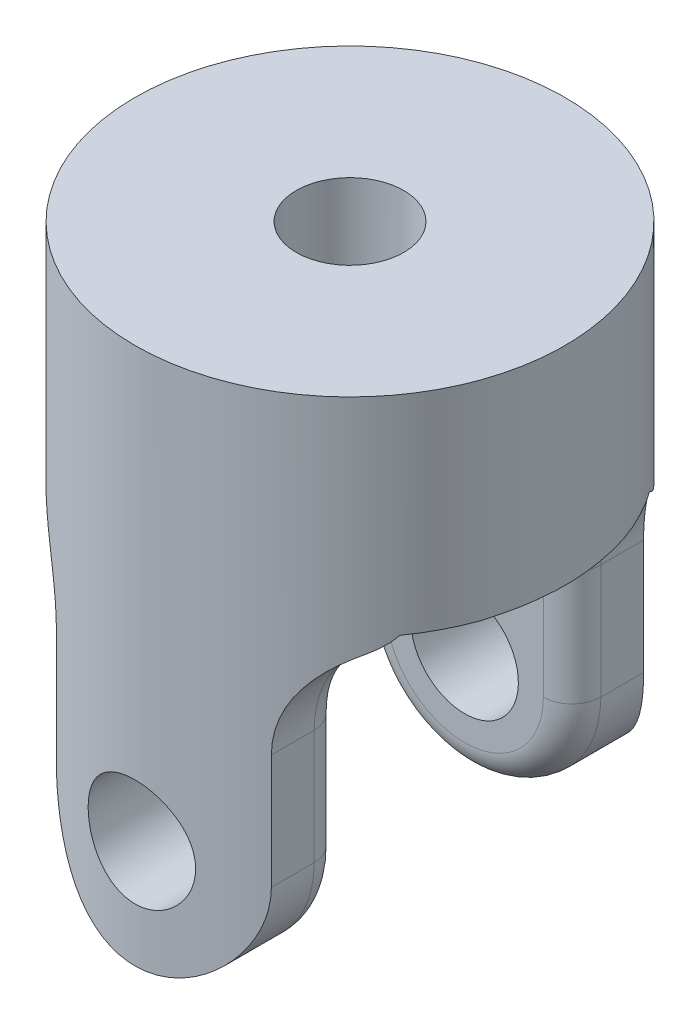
ISO-10303-21;
HEADER;
FILE_DESCRIPTION(('STEP AP214'),'2;1');
FILE_NAME('part.step','',(''),(''),'','','');
FILE_SCHEMA(('AUTOMOTIVE_DESIGN { 1 0 10303 214 1 1 1 1 }'));
ENDSEC;
DATA;
#1=APPLICATION_CONTEXT('core data for automotive mechanical design processes');
#2=APPLICATION_PROTOCOL_DEFINITION('international standard','automotive_design',2000,#1);
#3=PRODUCT_CONTEXT('',#1,'mechanical');
#4=PRODUCT('Part','Part','',(#3));
#5=PRODUCT_RELATED_PRODUCT_CATEGORY('part','',(#4));
#6=PRODUCT_DEFINITION_FORMATION('','',#4);
#7=PRODUCT_DEFINITION_CONTEXT('part definition',#1,'design');
#8=PRODUCT_DEFINITION('design','',#6,#7);
#9=PRODUCT_DEFINITION_SHAPE('','',#8);
#10=(LENGTH_UNIT() NAMED_UNIT(*) SI_UNIT(.MILLI.,.METRE.));
#11=(NAMED_UNIT(*) PLANE_ANGLE_UNIT() SI_UNIT($,.RADIAN.));
#12=(NAMED_UNIT(*) SI_UNIT($,.STERADIAN.) SOLID_ANGLE_UNIT());
#13=UNCERTAINTY_MEASURE_WITH_UNIT(LENGTH_MEASURE(1.E-05),#10,'distance_accuracy_value','');
#14=(GEOMETRIC_REPRESENTATION_CONTEXT(3) GLOBAL_UNCERTAINTY_ASSIGNED_CONTEXT((#13)) GLOBAL_UNIT_ASSIGNED_CONTEXT((#10,
#11,#12)) REPRESENTATION_CONTEXT('',''));
#15=CARTESIAN_POINT('',(0.,0.,0.));
#16=DIRECTION('',(0.,0.,1.));
#17=DIRECTION('',(1.,0.,0.));
#18=AXIS2_PLACEMENT_3D('',#15,#16,#17);
#19=CARTESIAN_POINT('',(0.,47.625,0.));
#20=DIRECTION('',(0.,-1.,0.));
#21=DIRECTION('',(0.,0.,-1.));
#22=AXIS2_PLACEMENT_3D('',#19,#20,#21);
#23=CYLINDRICAL_SURFACE('',#22,19.05);
#24=CARTESIAN_POINT('',(0.,14.2875,-19.05));
#25=CARTESIAN_POINT('',(-0.263131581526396,14.2874926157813,-19.0499955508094));
#26=CARTESIAN_POINT('',(-0.526345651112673,14.2656193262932,-19.0444938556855));
#27=CARTESIAN_POINT('',(-1.04523007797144,14.1788351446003,-19.0230796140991));
#28=CARTESIAN_POINT('',(-1.3008960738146,14.1138998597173,-19.0071611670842));
#29=CARTESIAN_POINT('',(-1.79711626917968,13.9432053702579,-18.966676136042));
#30=CARTESIAN_POINT('',(-2.03768821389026,13.837495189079,-18.9421199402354));
#31=CARTESIAN_POINT('',(-2.49768401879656,13.5884240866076,-18.886974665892));
#32=CARTESIAN_POINT('',(-2.71710716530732,13.4450618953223,-18.8563853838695));
#33=CARTESIAN_POINT('',(-3.13309611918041,13.121637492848,-18.7917903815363));
#34=CARTESIAN_POINT('',(-3.32916431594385,12.940945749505,-18.757731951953));
#35=CARTESIAN_POINT('',(-3.68855284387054,12.5493392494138,-18.6903874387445));
#36=CARTESIAN_POINT('',(-3.85186947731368,12.3384210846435,-18.6571014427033));
#37=CARTESIAN_POINT('',(-4.14345927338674,11.8884851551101,-18.5945391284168));
#38=CARTESIAN_POINT('',(-4.27117578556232,11.6490964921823,-18.5653297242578));
#39=CARTESIAN_POINT('',(-4.48436018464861,11.1513987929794,-18.514996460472));
#40=CARTESIAN_POINT('',(-4.56983482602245,10.8930927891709,-18.4938713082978));
#41=CARTESIAN_POINT('',(-4.69441160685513,10.3703643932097,-18.4626401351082));
#42=CARTESIAN_POINT('',(-4.73440845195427,10.1061682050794,-18.4523218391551));
#43=CARTESIAN_POINT('',(-4.76968113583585,9.57462979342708,-18.443237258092));
#44=CARTESIAN_POINT('',(-4.7649642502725,9.30728808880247,-18.4444690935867));
#45=CARTESIAN_POINT('',(-4.71165721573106,8.78390481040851,-18.4581547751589));
#46=CARTESIAN_POINT('',(-4.66413323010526,8.52774640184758,-18.4703359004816));
#47=CARTESIAN_POINT('',(-4.528261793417,8.02715866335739,-18.5041130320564));
#48=CARTESIAN_POINT('',(-4.43991143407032,7.78273017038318,-18.5257097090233));
#49=CARTESIAN_POINT('',(-4.22398659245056,7.30968179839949,-18.5761348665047));
#50=CARTESIAN_POINT('',(-4.09602516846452,7.08124640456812,-18.6050341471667));
#51=CARTESIAN_POINT('',(-3.80478117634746,6.6487080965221,-18.6667683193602));
#52=CARTESIAN_POINT('',(-3.64149242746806,6.44460944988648,-18.6996038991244));
#53=CARTESIAN_POINT('',(-3.27870637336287,6.06042852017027,-18.7666592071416));
#54=CARTESIAN_POINT('',(-3.07830936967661,5.88119699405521,-18.8008917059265));
#55=CARTESIAN_POINT('',(-2.64989283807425,5.55872255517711,-18.8660394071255));
#56=CARTESIAN_POINT('',(-2.42187246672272,5.41548074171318,-18.8969545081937));
#57=CARTESIAN_POINT('',(-1.94346794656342,5.16873938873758,-18.9521379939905));
#58=CARTESIAN_POINT('',(-1.69300967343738,5.06537804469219,-18.9763831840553));
#59=CARTESIAN_POINT('',(-1.17753132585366,4.90246255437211,-19.0153263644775));
#60=CARTESIAN_POINT('',(-0.912514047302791,4.84290002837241,-19.0300261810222));
#61=CARTESIAN_POINT('',(-0.382714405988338,4.77057222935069,-19.0479521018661));
#62=CARTESIAN_POINT('',(-0.11809958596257,4.75664839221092,-19.0514621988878));
#63=CARTESIAN_POINT('',(0.409679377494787,4.77281558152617,-19.0474220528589));
#64=CARTESIAN_POINT('',(0.672843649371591,4.80290264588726,-19.0398728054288));
#65=CARTESIAN_POINT('',(1.18622530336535,4.90528263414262,-19.0147442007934));
#66=CARTESIAN_POINT('',(1.43657675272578,4.97694351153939,-18.9973151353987));
#67=CARTESIAN_POINT('',(1.92169190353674,5.15971499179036,-18.9543914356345));
#68=CARTESIAN_POINT('',(2.15645402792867,5.27082957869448,-18.928895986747));
#69=CARTESIAN_POINT('',(2.60833595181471,5.5315997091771,-18.8719875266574));
#70=CARTESIAN_POINT('',(2.82506877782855,5.6819041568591,-18.8404775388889));
#71=CARTESIAN_POINT('',(3.23064699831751,6.015957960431,-18.7751881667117));
#72=CARTESIAN_POINT('',(3.41948756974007,6.19971308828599,-18.7414083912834));
#73=CARTESIAN_POINT('',(3.76869505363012,6.60083122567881,-18.6743643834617));
#74=CARTESIAN_POINT('',(3.92824927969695,6.81890845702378,-18.6411331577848));
#75=CARTESIAN_POINT('',(4.20849665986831,7.27942611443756,-18.5798738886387));
#76=CARTESIAN_POINT('',(4.32919153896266,7.5218654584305,-18.5518456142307));
#77=CARTESIAN_POINT('',(4.5273957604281,8.02292566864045,-18.5044745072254));
#78=CARTESIAN_POINT('',(4.60516095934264,8.28144021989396,-18.4850803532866));
#79=CARTESIAN_POINT('',(4.71597247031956,8.80843310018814,-18.457124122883));
#80=CARTESIAN_POINT('',(4.7490285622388,9.0769092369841,-18.4485596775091));
#81=CARTESIAN_POINT('',(4.76897252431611,9.60793425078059,-18.4434131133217));
#82=CARTESIAN_POINT('',(4.75715932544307,9.87043185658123,-18.4464938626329));
#83=CARTESIAN_POINT('',(4.69067285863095,10.3895648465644,-18.4635111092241));
#84=CARTESIAN_POINT('',(4.63600045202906,10.6462003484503,-18.4774473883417));
#85=CARTESIAN_POINT('',(4.48605693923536,11.1449118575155,-18.5144175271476));
#86=CARTESIAN_POINT('',(4.3910294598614,11.3870654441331,-18.5373967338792));
#87=CARTESIAN_POINT('',(4.1632661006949,11.8521650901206,-18.5898712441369));
#88=CARTESIAN_POINT('',(4.03052499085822,12.0751084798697,-18.6193674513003));
#89=CARTESIAN_POINT('',(3.72703010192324,12.5017359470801,-18.6825138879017));
#90=CARTESIAN_POINT('',(3.5553750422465,12.7047659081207,-18.7162524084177));
#91=CARTESIAN_POINT('',(3.18068125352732,13.0795618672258,-18.7835548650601));
#92=CARTESIAN_POINT('',(2.97763508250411,13.2513204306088,-18.8171187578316));
#93=CARTESIAN_POINT('',(2.54148458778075,13.5617309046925,-18.8810155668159));
#94=CARTESIAN_POINT('',(2.30790249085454,13.6997268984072,-18.911278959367));
#95=CARTESIAN_POINT('',(1.82011973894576,13.9342731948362,-18.9644313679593));
#96=CARTESIAN_POINT('',(1.56593401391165,14.0308531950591,-18.9873256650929));
#97=CARTESIAN_POINT('',(1.09350255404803,14.1654905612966,-19.0197758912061));
#98=CARTESIAN_POINT('',(0.877507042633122,14.2111451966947,-19.031032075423));
#99=CARTESIAN_POINT('',(0.441026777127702,14.2721518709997,-19.0461457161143));
#100=CARTESIAN_POINT('',(0.220542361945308,14.2875061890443,-19.0500037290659));
#101=CARTESIAN_POINT('',(0.,14.2875,-19.05));
#102=B_SPLINE_CURVE_WITH_KNOTS('',3,(#24,#25,#26,#27,#28,#29,#30,#31,#32,#33,#34,#35,#36,#37,
#38,#39,#40,#41,#42,#43,#44,#45,#46,#47,#48,#49,#50,#51,#52,#53,#54,#55,#56,#57,#58,#59,#60,#61,
#62,#63,#64,#65,#66,#67,#68,#69,#70,#71,#72,#73,#74,#75,#76,#77,#78,#79,#80,#81,#82,#83,#84,#85,
#86,#87,#88,#89,#90,#91,#92,#93,#94,#95,#96,#97,#98,#99,#100,#101),.UNSPECIFIED.,.T.,.F.,(4,2,2,
2,2,2,2,2,2,2,2,2,2,2,2,2,2,2,2,2,2,2,2,2,2,2,2,2,2,2,2,2,2,2,2,2,2,2,4),(0.,0.78858653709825,
1.57762015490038,2.36570806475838,3.15382256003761,3.95650832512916,4.75928466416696,
5.57398705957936,6.38855914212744,7.18681236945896,7.98493571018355,8.76371428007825,
9.54254833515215,10.3292442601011,11.1160779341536,11.9253476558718,12.7346420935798,
13.5467162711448,14.3586350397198,15.1497763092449,15.940846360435,16.7201937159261,
17.4996197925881,18.2928764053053,19.08627002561,19.8991381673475,20.7119702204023,
21.5199040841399,22.3276611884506,23.1122150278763,23.8967531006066,24.6766207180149,
25.4565965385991,26.2569190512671,27.0574315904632,27.8724418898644,28.6868668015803,
29.3478662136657,30.008815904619),.UNSPECIFIED.);
#103=CARTESIAN_POINT('',(0.,14.2875,-19.05));
#104=VERTEX_POINT('',#103);
#105=EDGE_CURVE('E247',#104,#104,#102,.T.);
#106=ORIENTED_EDGE('',*,*,#105,.T.);
#107=EDGE_LOOP('',(#106));
#108=FACE_BOUND('',#107,.T.);
#109=CARTESIAN_POINT('',(4.7625,9.525,18.4450831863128));
#110=CARTESIAN_POINT('',(4.7624925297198,9.26201331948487,18.4450882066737));
#111=CARTESIAN_POINT('',(4.74064249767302,8.99894396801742,18.4507690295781));
#112=CARTESIAN_POINT('',(4.65395905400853,8.48035976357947,18.4728204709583));
#113=CARTESIAN_POINT('',(4.58910062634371,8.22484939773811,18.4891973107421));
#114=CARTESIAN_POINT('',(4.41863073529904,7.72895925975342,18.5306727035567));
#115=CARTESIAN_POINT('',(4.31307188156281,7.48856041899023,18.5557599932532));
#116=CARTESIAN_POINT('',(4.06435777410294,7.02885782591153,18.6118155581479));
#117=CARTESIAN_POINT('',(3.92120092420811,6.80955496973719,18.6427840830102));
#118=CARTESIAN_POINT('',(3.59798955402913,6.39344356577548,18.7078756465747));
#119=CARTESIAN_POINT('',(3.41725927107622,6.19716769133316,18.7420490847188));
#120=CARTESIAN_POINT('',(3.02548683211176,5.83737454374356,18.8092627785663));
#121=CARTESIAN_POINT('',(2.81444184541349,5.67386033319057,18.8423029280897));
#122=CARTESIAN_POINT('',(2.36438160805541,5.38205273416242,18.9040849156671));
#123=CARTESIAN_POINT('',(2.12501716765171,5.25428263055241,18.9327603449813));
#124=CARTESIAN_POINT('',(1.62737136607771,5.04099262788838,18.98200696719));
#125=CARTESIAN_POINT('',(1.36909280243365,4.95546649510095,19.0025793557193));
#126=CARTESIAN_POINT('',(0.846503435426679,4.8307983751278,19.0329456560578));
#127=CARTESIAN_POINT('',(0.582420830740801,4.79075182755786,19.0429494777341));
#128=CARTESIAN_POINT('',(0.0511089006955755,4.75534028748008,19.0517829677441));
#129=CARTESIAN_POINT('',(-0.216119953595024,4.75996868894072,19.0506142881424));
#130=CARTESIAN_POINT('',(-0.739865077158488,4.81312508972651,19.0373907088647));
#131=CARTESIAN_POINT('',(-0.996487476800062,4.86067669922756,19.0255779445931));
#132=CARTESIAN_POINT('',(-1.4979884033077,4.99676026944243,18.992675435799));
#133=CARTESIAN_POINT('',(-1.74286630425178,5.08529441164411,18.9715851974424));
#134=CARTESIAN_POINT('',(-2.21649942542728,5.30161989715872,18.9221270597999));
#135=CARTESIAN_POINT('',(-2.44508897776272,5.42975872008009,18.8936951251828));
#136=CARTESIAN_POINT('',(-2.87786265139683,5.72139256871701,18.8326376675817));
#137=CARTESIAN_POINT('',(-3.08204251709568,5.88489374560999,18.8000114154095));
#138=CARTESIAN_POINT('',(-3.46602384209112,6.24784515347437,18.733078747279));
#139=CARTESIAN_POINT('',(-3.64501594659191,6.44814856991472,18.6987507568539));
#140=CARTESIAN_POINT('',(-3.96704999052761,6.87628794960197,18.6330915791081));
#141=CARTESIAN_POINT('',(-4.11009024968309,7.10412519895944,18.6017605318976));
#142=CARTESIAN_POINT('',(-4.35667846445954,7.58245251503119,18.5455654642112));
#143=CARTESIAN_POINT('',(-4.46003156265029,7.8330470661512,18.5207335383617));
#144=CARTESIAN_POINT('',(-4.6228902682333,8.34882531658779,18.4807600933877));
#145=CARTESIAN_POINT('',(-4.68240525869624,8.61400588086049,18.4656165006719));
#146=CARTESIAN_POINT('',(-4.75455546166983,9.14392285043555,18.4471695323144));
#147=CARTESIAN_POINT('',(-4.76838735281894,9.40848599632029,18.4435639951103));
#148=CARTESIAN_POINT('',(-4.75205486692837,9.93614078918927,18.4477788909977));
#149=CARTESIAN_POINT('',(-4.72189453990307,10.1992325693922,18.4555982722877));
#150=CARTESIAN_POINT('',(-4.61948300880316,10.7120326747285,18.4814924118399));
#151=CARTESIAN_POINT('',(-4.54792855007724,10.9618895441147,18.4993972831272));
#152=CARTESIAN_POINT('',(-4.36553244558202,11.4460619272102,18.5432836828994));
#153=CARTESIAN_POINT('',(-4.25468614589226,11.6803755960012,18.5692661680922));
#154=CARTESIAN_POINT('',(-3.99434812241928,12.1318806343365,18.6270164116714));
#155=CARTESIAN_POINT('',(-3.84414094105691,12.3486459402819,18.6588876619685));
#156=CARTESIAN_POINT('',(-3.51024964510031,12.7543338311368,18.7245704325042));
#157=CARTESIAN_POINT('',(-3.3265600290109,12.9432518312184,18.7583822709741));
#158=CARTESIAN_POINT('',(-2.92542620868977,13.2927300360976,18.8251605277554));
#159=CARTESIAN_POINT('',(-2.70725242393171,13.4524624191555,18.8580846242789));
#160=CARTESIAN_POINT('',(-2.24648402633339,13.7330228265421,18.9185019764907));
#161=CARTESIAN_POINT('',(-2.00389068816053,13.8538528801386,18.9459955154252));
#162=CARTESIAN_POINT('',(-1.50284593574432,14.0521296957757,18.9922807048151));
#163=CARTESIAN_POINT('',(-1.24452402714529,14.1298884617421,19.0111347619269));
#164=CARTESIAN_POINT('',(-0.717945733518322,14.240751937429,19.0382898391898));
#165=CARTESIAN_POINT('',(-0.449691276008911,14.2738652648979,19.0465928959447));
#166=CARTESIAN_POINT('',(0.0813602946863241,14.2940131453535,19.0516273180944));
#167=CARTESIAN_POINT('',(0.344108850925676,14.2822693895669,19.0486654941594));
#168=CARTESIAN_POINT('',(0.863762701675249,14.2158347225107,19.0321833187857));
#169=CARTESIAN_POINT('',(1.12066816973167,14.1611450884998,19.0186632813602));
#170=CARTESIAN_POINT('',(1.62006455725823,14.0110263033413,18.9826312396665));
#171=CARTESIAN_POINT('',(1.86262563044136,13.9158180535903,18.9601680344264));
#172=CARTESIAN_POINT('',(2.32846746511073,13.6875651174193,18.908615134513));
#173=CARTESIAN_POINT('',(2.55174579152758,13.5545156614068,18.8795246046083));
#174=CARTESIAN_POINT('',(2.97847668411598,13.2506311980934,18.8169827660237));
#175=CARTESIAN_POINT('',(3.18132613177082,13.0789673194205,18.7834436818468));
#176=CARTESIAN_POINT('',(3.55575403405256,12.7043361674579,18.7161796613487));
#177=CARTESIAN_POINT('',(3.72732454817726,12.5013609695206,18.6824546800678));
#178=CARTESIAN_POINT('',(4.0374666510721,12.0653107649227,18.6179210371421));
#179=CARTESIAN_POINT('',(4.1753628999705,11.831744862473,18.5871785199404));
#180=CARTESIAN_POINT('',(4.4097268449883,11.3440107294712,18.5329808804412));
#181=CARTESIAN_POINT('',(4.50622468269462,11.0898576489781,18.5095204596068));
#182=CARTESIAN_POINT('',(4.6406872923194,10.6176269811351,18.4762096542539));
#183=CARTESIAN_POINT('',(4.68626747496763,10.401808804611,18.4646250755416));
#184=CARTESIAN_POINT('',(4.74717566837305,9.96567951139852,18.4490600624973));
#185=CARTESIAN_POINT('',(4.76250625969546,9.74536877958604,18.4450789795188));
#186=CARTESIAN_POINT('',(4.7625,9.525,18.4450831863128));
#187=B_SPLINE_CURVE_WITH_KNOTS('',3,(#109,#110,#111,#112,#113,#114,#115,#116,#117,#118,#119,
#120,#121,#122,#123,#124,#125,#126,#127,#128,#129,#130,#131,#132,#133,#134,#135,#136,#137,#138,
#139,#140,#141,#142,#143,#144,#145,#146,#147,#148,#149,#150,#151,#152,#153,#154,#155,#156,#157,
#158,#159,#160,#161,#162,#163,#164,#165,#166,#167,#168,#169,#170,#171,#172,#173,#174,#175,#176,
#177,#178,#179,#180,#181,#182,#183,#184,#185,#186),.UNSPECIFIED.,.T.,.F.,(4,2,2,2,2,2,2,2,2,2,2,
2,2,2,2,2,2,2,2,2,2,2,2,2,2,2,2,2,2,2,2,2,2,2,2,2,2,2,4),(0.,0.788150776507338,1.57676038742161,
2.36435403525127,3.15198112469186,3.95523632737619,4.75856658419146,5.57310600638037,
6.3875251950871,7.18544570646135,7.98324823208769,8.76334790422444,9.54348910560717,
10.3306792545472,11.1180064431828,11.9266423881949,12.7353161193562,13.5479110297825,
14.3603319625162,15.1512950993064,15.9421854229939,16.7201355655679,17.4981778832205,
18.2914832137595,19.0849190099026,19.8982075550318,20.7114536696,21.5187289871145,
22.3258484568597,23.1111446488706,23.896417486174,24.677462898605,25.4586067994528,
26.258464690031,27.0585253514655,27.8735118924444,28.6879040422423,29.3483886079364,
30.0088168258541),.UNSPECIFIED.);
#188=CARTESIAN_POINT('',(4.7625,9.525,18.4450831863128));
#189=VERTEX_POINT('',#188);
#190=EDGE_CURVE('E251',#189,#189,#187,.T.);
#191=ORIENTED_EDGE('',*,*,#190,.T.);
#192=EDGE_LOOP('',(#191));
#193=FACE_BOUND('',#192,.T.);
#194=CARTESIAN_POINT('',(0.,47.625,0.));
#195=DIRECTION('',(0.,1.,0.));
#196=DIRECTION('',(0.,0.,1.));
#197=AXIS2_PLACEMENT_3D('',#194,#195,#196);
#198=CIRCLE('',#197,19.05);
#199=CARTESIAN_POINT('',(0.,47.625,19.05));
#200=VERTEX_POINT('',#199);
#201=EDGE_CURVE('E254',#200,#200,#198,.T.);
#202=ORIENTED_EDGE('',*,*,#201,.F.);
#203=EDGE_LOOP('',(#202));
#204=FACE_BOUND('',#203,.T.);
#205=CARTESIAN_POINT('',(0.,29.1452388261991,0.));
#206=DIRECTION('',(0.,-1.,0.));
#207=DIRECTION('',(0.,0.,-1.));
#208=AXIS2_PLACEMENT_3D('',#205,#206,#207);
#209=CIRCLE('',#208,19.05);
#210=CARTESIAN_POINT('',(-15.4943364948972,29.1452388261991,11.0827810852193));
#211=VERTEX_POINT('',#210);
#212=CARTESIAN_POINT('',(-17.9411689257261,29.1452388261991,6.40444826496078));
#213=VERTEX_POINT('',#212);
#214=EDGE_CURVE('E183',#211,#213,#209,.T.);
#215=ORIENTED_EDGE('',*,*,#214,.F.);
#216=CARTESIAN_POINT('',(-15.4943364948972,29.1452388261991,11.0827810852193));
#217=CARTESIAN_POINT('',(-15.4603741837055,29.0905949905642,11.1302640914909));
#218=CARTESIAN_POINT('',(-15.4254074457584,29.0374234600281,11.1786861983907));
#219=CARTESIAN_POINT('',(-15.3535947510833,28.9339301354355,11.2771153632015));
#220=CARTESIAN_POINT('',(-15.3167494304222,28.8836073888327,11.3271218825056));
#221=CARTESIAN_POINT('',(-15.2036555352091,28.7368475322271,11.4789919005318));
#222=CARTESIAN_POINT('',(-15.1247575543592,28.6444732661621,11.5828343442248));
#223=CARTESIAN_POINT('',(-14.9617748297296,28.4709223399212,11.7925923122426));
#224=CARTESIAN_POINT('',(-14.8777684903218,28.3896186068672,11.8984648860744));
#225=CARTESIAN_POINT('',(-14.7042203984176,28.2361548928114,12.1122813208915));
#226=CARTESIAN_POINT('',(-14.6146784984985,28.163995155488,12.2202252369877));
#227=CARTESIAN_POINT('',(-14.4703734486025,28.0577974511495,12.3902102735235));
#228=CARTESIAN_POINT('',(-14.417341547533,28.0207832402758,12.4518864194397));
#229=CARTESIAN_POINT('',(-14.309482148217,27.9494298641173,12.5756903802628));
#230=CARTESIAN_POINT('',(-14.2546487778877,27.9151010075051,12.6378190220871));
#231=CARTESIAN_POINT('',(-14.1990316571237,27.8821782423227,12.6999999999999));
#232=B_SPLINE_CURVE_WITH_KNOTS('',3,(#216,#217,#218,#219,#220,#221,#222,#223,#224,#225,#226,
#227,#228,#229,#230,#231),.UNSPECIFIED.,.F.,.F.,(4,2,2,2,2,2,2,4),(0.,0.239826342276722,
0.479572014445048,0.958421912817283,1.43120327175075,1.90399722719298,2.1720456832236,
2.44107721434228),.UNSPECIFIED.);
#233=CARTESIAN_POINT('',(-14.1990316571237,27.8821782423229,12.7));
#234=VERTEX_POINT('',#233);
#235=EDGE_CURVE('E388',#211,#234,#232,.T.);
#236=ORIENTED_EDGE('',*,*,#235,.T.);
#237=CARTESIAN_POINT('',(-9.525,19.685,16.4977839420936));
#238=CARTESIAN_POINT('',(-9.52496088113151,19.918350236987,16.4977688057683));
#239=CARTESIAN_POINT('',(-9.53357353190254,20.1516967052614,16.4928328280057));
#240=CARTESIAN_POINT('',(-9.56782146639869,20.6166980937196,16.4730087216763));
#241=CARTESIAN_POINT('',(-9.59345572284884,20.8483531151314,16.4581211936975));
#242=CARTESIAN_POINT('',(-9.66141942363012,21.3080009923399,16.4183108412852));
#243=CARTESIAN_POINT('',(-9.70372594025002,21.5359984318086,16.3934017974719));
#244=CARTESIAN_POINT('',(-9.80447669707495,21.9870210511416,16.3333461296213));
#245=CARTESIAN_POINT('',(-9.86292069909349,22.2100463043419,16.2981996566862));
#246=CARTESIAN_POINT('',(-9.99521577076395,22.6496636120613,16.217402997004));
#247=CARTESIAN_POINT('',(-10.0690752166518,22.8662520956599,16.1717470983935));
#248=CARTESIAN_POINT('',(-10.2311827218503,23.2913603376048,16.0696785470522));
#249=CARTESIAN_POINT('',(-10.3194309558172,23.4998799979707,16.0132657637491));
#250=CARTESIAN_POINT('',(-10.5090589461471,23.9073731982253,15.8894615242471));
#251=CARTESIAN_POINT('',(-10.6104339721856,24.1063501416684,15.8220740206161));
#252=CARTESIAN_POINT('',(-10.8249101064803,24.4935871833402,15.676116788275));
#253=CARTESIAN_POINT('',(-10.9380111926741,24.6818473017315,15.597547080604));
#254=CARTESIAN_POINT('',(-11.1750060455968,25.0476354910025,15.4286429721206));
#255=CARTESIAN_POINT('',(-11.2989577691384,25.2250961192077,15.3382439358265));
#256=CARTESIAN_POINT('',(-11.5553164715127,25.5672655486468,15.1460495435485));
#257=CARTESIAN_POINT('',(-11.6877234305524,25.7319743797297,15.0442542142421));
#258=CARTESIAN_POINT('',(-11.9591574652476,26.0480960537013,14.8293967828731));
#259=CARTESIAN_POINT('',(-12.0981857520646,26.1995064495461,14.7163326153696));
#260=CARTESIAN_POINT('',(-12.3809708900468,26.4887188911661,14.4792302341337));
#261=CARTESIAN_POINT('',(-12.5247282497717,26.6265194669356,14.3551908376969));
#262=CARTESIAN_POINT('',(-12.8240785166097,26.8965620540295,14.0885806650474));
#263=CARTESIAN_POINT('',(-12.9798547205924,27.0279377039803,13.9453388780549));
#264=CARTESIAN_POINT('',(-13.292575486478,27.2756182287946,13.6475843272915));
#265=CARTESIAN_POINT('',(-13.4495200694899,27.3919228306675,13.4930713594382));
#266=CARTESIAN_POINT('',(-13.7627279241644,27.6100750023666,13.1734537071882));
#267=CARTESIAN_POINT('',(-13.91899104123,27.7119194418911,13.0083467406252));
#268=CARTESIAN_POINT('',(-14.2291584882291,27.9019462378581,12.6683290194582));
#269=CARTESIAN_POINT('',(-14.3830623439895,27.9901258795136,12.4934163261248));
#270=CARTESIAN_POINT('',(-14.7634251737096,28.1948863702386,12.0444336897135));
#271=CARTESIAN_POINT('',(-14.9875078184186,28.3034922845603,11.7646791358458));
#272=CARTESIAN_POINT('',(-15.4232003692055,28.4957157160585,11.1874194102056));
#273=CARTESIAN_POINT('',(-15.6348051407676,28.5793230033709,10.8899070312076));
#274=CARTESIAN_POINT('',(-16.0431146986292,28.7255421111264,10.2789237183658));
#275=CARTESIAN_POINT('',(-16.2397846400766,28.7881059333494,9.96541815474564));
#276=CARTESIAN_POINT('',(-16.615638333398,28.8957388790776,9.3252837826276));
#277=CARTESIAN_POINT('',(-16.7948218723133,28.9408077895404,8.99865481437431));
#278=CARTESIAN_POINT('',(-17.1918461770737,29.029905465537,8.22145899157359));
#279=CARTESIAN_POINT('',(-17.4021973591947,29.0684013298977,7.76641658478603));
#280=CARTESIAN_POINT('',(-17.786699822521,29.1278564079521,6.84014068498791));
#281=CARTESIAN_POINT('',(-17.9608394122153,29.1488099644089,6.36890201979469));
#282=CARTESIAN_POINT('',(-18.2714417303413,29.1794105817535,5.41378881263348));
#283=CARTESIAN_POINT('',(-18.4079009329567,29.1890565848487,4.92991309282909));
#284=CARTESIAN_POINT('',(-18.6421466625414,29.2019870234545,3.95287775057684));
#285=CARTESIAN_POINT('',(-18.7399368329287,29.2052720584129,3.45971900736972));
#286=CARTESIAN_POINT('',(-18.897358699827,29.2091078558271,2.46008138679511));
#287=CARTESIAN_POINT('',(-18.9564226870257,29.2096187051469,1.95351291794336));
#288=CARTESIAN_POINT('',(-19.033752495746,29.2100647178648,0.937263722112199));
#289=CARTESIAN_POINT('',(-19.0520174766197,29.209999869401,0.42758293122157));
#290=CARTESIAN_POINT('',(-19.0476285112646,29.2100001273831,-0.591825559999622));
#291=CARTESIAN_POINT('',(-19.0249568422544,29.2100652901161,-1.10155318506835));
#292=CARTESIAN_POINT('',(-18.9388075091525,29.2094475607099,-2.11754548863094));
#293=CARTESIAN_POINT('',(-18.8753295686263,29.2087646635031,-2.62381014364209));
#294=CARTESIAN_POINT('',(-18.7036160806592,29.2041086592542,-3.65580332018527));
#295=CARTESIAN_POINT('',(-18.5932233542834,29.1999661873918,-4.18117378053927));
#296=CARTESIAN_POINT('',(-18.3285057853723,29.1835599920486,-5.22073652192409));
#297=CARTESIAN_POINT('',(-18.1741722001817,29.1712946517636,-5.73492655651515));
#298=CARTESIAN_POINT('',(-17.8230306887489,29.1322930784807,-6.74751648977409));
#299=CARTESIAN_POINT('',(-17.6262637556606,29.1055707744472,-7.24593109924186));
#300=CARTESIAN_POINT('',(-17.1921907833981,29.0296619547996,-8.22291578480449));
#301=CARTESIAN_POINT('',(-16.9549063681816,28.9804873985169,-8.70149627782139));
#302=CARTESIAN_POINT('',(-16.5317482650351,28.8726944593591,-9.47232063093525));
#303=CARTESIAN_POINT('',(-16.356505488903,28.8232353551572,-9.77172744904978));
#304=CARTESIAN_POINT('',(-15.9915321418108,28.7076409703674,-10.3582119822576));
#305=CARTESIAN_POINT('',(-15.8018055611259,28.6415102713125,-10.6452930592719));
#306=CARTESIAN_POINT('',(-15.4100602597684,28.4895738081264,-11.2048655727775));
#307=CARTESIAN_POINT('',(-15.2080616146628,28.4037995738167,-11.4773795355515));
#308=CARTESIAN_POINT('',(-14.794100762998,28.2093882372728,-12.0062371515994));
#309=CARTESIAN_POINT('',(-14.5821407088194,28.1007560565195,-12.2625842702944));
#310=CARTESIAN_POINT('',(-14.1961331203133,27.8828084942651,-12.7059055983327));
#311=CARTESIAN_POINT('',(-14.0232896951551,27.7782615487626,-12.8962780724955));
#312=CARTESIAN_POINT('',(-13.6756323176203,27.5516907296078,-13.2643740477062));
#313=CARTESIAN_POINT('',(-13.5008188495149,27.4296710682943,-13.4421005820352));
#314=CARTESIAN_POINT('',(-13.1516762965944,27.1671845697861,-13.7838888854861));
#315=CARTESIAN_POINT('',(-12.9773471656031,27.0267195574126,-13.947952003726));
#316=CARTESIAN_POINT('',(-12.6319391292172,26.726763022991,-14.2615225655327));
#317=CARTESIAN_POINT('',(-12.4608602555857,26.5672713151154,-14.4110298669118));
#318=CARTESIAN_POINT('',(-12.1237135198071,26.2279198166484,-14.6958204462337));
#319=CARTESIAN_POINT('',(-11.957692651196,26.0479167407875,-14.8309890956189));
#320=CARTESIAN_POINT('',(-11.6351953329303,25.6689938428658,-15.0853214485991));
#321=CARTESIAN_POINT('',(-11.4787191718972,25.4700734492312,-15.2044846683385));
#322=CARTESIAN_POINT('',(-11.1784747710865,25.0543983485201,-15.4265708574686));
#323=CARTESIAN_POINT('',(-11.0347050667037,24.8376457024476,-15.5294956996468));
#324=CARTESIAN_POINT('',(-10.7628059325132,24.3878782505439,-15.7191604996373));
#325=CARTESIAN_POINT('',(-10.6346741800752,24.154865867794,-15.8059028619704));
#326=CARTESIAN_POINT('',(-10.4115375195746,23.7046522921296,-15.9536199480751));
#327=CARTESIAN_POINT('',(-10.3143937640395,23.4891174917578,-16.0164604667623));
#328=CARTESIAN_POINT('',(-10.1355425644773,23.04871010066,-16.1302361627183));
#329=CARTESIAN_POINT('',(-10.0538339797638,22.8238382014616,-16.181172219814));
#330=CARTESIAN_POINT('',(-9.90713729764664,22.3666546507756,-16.2714028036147));
#331=CARTESIAN_POINT('',(-9.84213485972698,22.1343495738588,-16.3107073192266));
#332=CARTESIAN_POINT('',(-9.72972257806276,21.664017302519,-16.3780123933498));
#333=CARTESIAN_POINT('',(-9.6823065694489,21.4259921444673,-16.4060169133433));
#334=CARTESIAN_POINT('',(-9.60449707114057,20.9383691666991,-16.4516946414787));
#335=CARTESIAN_POINT('',(-9.57468865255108,20.6886433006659,-16.4690135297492));
#336=CARTESIAN_POINT('',(-9.54488066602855,20.3127872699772,-16.48629321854));
#337=CARTESIAN_POINT('',(-9.5374287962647,20.1873921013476,-16.4906033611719));
#338=CARTESIAN_POINT('',(-9.52748802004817,19.9363374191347,-16.4963477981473));
#339=CARTESIAN_POINT('',(-9.52499919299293,19.8106779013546,-16.4977820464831));
#340=CARTESIAN_POINT('',(-9.525,19.685,-16.4977839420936));
#341=B_SPLINE_CURVE_WITH_KNOTS('',3,(#237,#238,#239,#240,#241,#242,#243,#244,#245,#246,#247,
#248,#249,#250,#251,#252,#253,#254,#255,#256,#257,#258,#259,#260,#261,#262,#263,#264,#265,#266,
#267,#268,#269,#270,#271,#272,#273,#274,#275,#276,#277,#278,#279,#280,#281,#282,#283,#284,#285,
#286,#287,#288,#289,#290,#291,#292,#293,#294,#295,#296,#297,#298,#299,#300,#301,#302,#303,#304,
#305,#306,#307,#308,#309,#310,#311,#312,#313,#314,#315,#316,#317,#318,#319,#320,#321,#322,#323,
#324,#325,#326,#327,#328,#329,#330,#331,#332,#333,#334,#335,#336,#337,#338,#339,#340),
.UNSPECIFIED.,.F.,.F.,(4,2,2,2,2,2,2,2,2,2,2,2,2,2,2,2,2,2,2,2,2,2,2,2,2,2,2,2,2,2,2,2,2,2,2,2,
2,2,2,2,2,2,2,2,2,2,2,2,2,2,2,4),(0.,0.699834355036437,1.39962647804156,2.09845958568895,
2.79728237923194,3.49648588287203,4.19569787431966,4.8946585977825,5.59361800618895,
6.29656980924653,6.99951996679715,7.70259920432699,8.40575429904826,9.15225685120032,
9.89877292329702,10.6454503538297,11.3922759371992,12.514141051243,13.6364646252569,
14.7613310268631,15.8862111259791,17.392458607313,18.899191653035,20.40606563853,
21.9127976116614,23.4411511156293,24.9695361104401,26.4985829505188,28.0276401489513,
29.6362655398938,31.2452112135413,32.852609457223,34.4591525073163,35.50965675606,
36.5598726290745,37.6084144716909,38.6567307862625,39.4886840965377,40.3204371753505,
41.1521080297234,41.9837870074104,42.8216802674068,43.6595988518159,44.4974207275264,
45.3351180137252,46.0680642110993,46.8009562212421,47.5332170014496,48.2652208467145,
49.02034913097,49.3973072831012,49.7742714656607),.UNSPECIFIED.);
#342=CARTESIAN_POINT('',(-9.525,19.685,16.4977839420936));
#343=VERTEX_POINT('',#342);
#344=EDGE_CURVE('E261',#343,#234,#341,.T.);
#345=ORIENTED_EDGE('',*,*,#344,.F.);
#346=DIRECTION('',(0.,-1.,0.));
#347=VECTOR('',#346,1.);
#348=CARTESIAN_POINT('',(-9.525,47.625,16.4977839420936));
#349=LINE('',#348,#347);
#350=CARTESIAN_POINT('',(-9.525,9.525,16.4977839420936));
#351=VERTEX_POINT('',#350);
#352=EDGE_CURVE('E189',#351,#343,#349,.F.);
#353=ORIENTED_EDGE('',*,*,#352,.F.);
#354=CARTESIAN_POINT('',(-9.525,9.525,16.4977839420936));
#355=CARTESIAN_POINT('',(-9.52500093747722,9.40027257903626,16.4977810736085));
#356=CARTESIAN_POINT('',(-9.5225495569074,9.27556275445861,16.4991989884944));
#357=CARTESIAN_POINT('',(-9.51275833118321,9.02640408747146,16.504847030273));
#358=CARTESIAN_POINT('',(-9.50541869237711,8.90195523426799,16.5090770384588));
#359=CARTESIAN_POINT('',(-9.47610793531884,8.52953393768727,16.5259318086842));
#360=CARTESIAN_POINT('',(-9.4468449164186,8.28227418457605,16.5427214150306));
#361=CARTESIAN_POINT('',(-9.36949132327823,7.79316834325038,16.5866536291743));
#362=CARTESIAN_POINT('',(-9.32150961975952,7.55129934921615,16.6137363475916));
#363=CARTESIAN_POINT('',(-9.20730560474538,7.07314911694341,16.6772985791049));
#364=CARTESIAN_POINT('',(-9.14108119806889,6.83686852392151,16.7137791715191));
#365=CARTESIAN_POINT('',(-8.99129510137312,6.37194751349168,16.7948306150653));
#366=CARTESIAN_POINT('',(-8.90777526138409,6.14329017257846,16.8393819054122));
#367=CARTESIAN_POINT('',(-8.72407711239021,5.69420111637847,16.9352799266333));
#368=CARTESIAN_POINT('',(-8.62389244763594,5.47377257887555,16.9866292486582));
#369=CARTESIAN_POINT('',(-8.29930376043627,4.82601405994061,17.1488381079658));
#370=CARTESIAN_POINT('',(-8.05095104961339,4.41247529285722,17.2678097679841));
#371=CARTESIAN_POINT('',(-7.47383610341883,3.59736922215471,17.5257462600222));
#372=CARTESIAN_POINT('',(-7.14015861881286,3.19954734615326,17.6655504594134));
#373=CARTESIAN_POINT('',(-6.5945742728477,2.64718480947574,17.8732248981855));
#374=CARTESIAN_POINT('',(-6.405096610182,2.47038257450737,17.9421446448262));
#375=CARTESIAN_POINT('',(-6.01181385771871,2.13237428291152,18.0777156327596));
#376=CARTESIAN_POINT('',(-5.80800671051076,1.97117047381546,18.1443665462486));
#377=CARTESIAN_POINT('',(-5.3727806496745,1.65505544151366,18.2781569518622));
#378=CARTESIAN_POINT('',(-5.14042653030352,1.5013140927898,18.3450225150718));
#379=CARTESIAN_POINT('',(-4.66194023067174,1.21417930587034,18.4724136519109));
#380=CARTESIAN_POINT('',(-4.41581396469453,1.08077722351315,18.5329419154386));
#381=CARTESIAN_POINT('',(-3.91130485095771,0.835583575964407,18.6459377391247));
#382=CARTESIAN_POINT('',(-3.65292491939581,0.723786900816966,18.6984072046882));
#383=CARTESIAN_POINT('',(-3.1257193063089,0.523053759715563,18.7937250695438));
#384=CARTESIAN_POINT('',(-2.85689473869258,0.434114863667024,18.8365744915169));
#385=CARTESIAN_POINT('',(-2.33040396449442,0.285723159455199,18.9086545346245));
#386=CARTESIAN_POINT('',(-2.07330466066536,0.224622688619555,18.9386372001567));
#387=CARTESIAN_POINT('',(-1.55394863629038,0.123892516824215,18.9883061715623));
#388=CARTESIAN_POINT('',(-1.29169214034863,0.0842618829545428,19.0079929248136));
#389=CARTESIAN_POINT('',(-0.76432935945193,0.0270138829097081,19.0364912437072));
#390=CARTESIAN_POINT('',(-0.499224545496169,0.00938565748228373,19.0453081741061));
#391=CARTESIAN_POINT('',(0.0316607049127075,-0.00364684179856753,19.0518227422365));
#392=CARTESIAN_POINT('',(0.297441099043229,0.000947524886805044,19.0495210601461));
#393=CARTESIAN_POINT('',(0.804260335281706,0.0309220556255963,19.0345541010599));
#394=CARTESIAN_POINT('',(1.04543822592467,0.0544573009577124,19.0228087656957));
#395=CARTESIAN_POINT('',(1.52469707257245,0.119714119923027,18.9904047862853));
#396=CARTESIAN_POINT('',(1.76277824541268,0.161434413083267,18.9697467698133));
#397=CARTESIAN_POINT('',(2.23423979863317,0.26260663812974,18.9200123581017));
#398=CARTESIAN_POINT('',(2.46762011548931,0.322058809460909,18.8909358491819));
#399=CARTESIAN_POINT('',(2.92820911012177,0.458088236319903,18.8250425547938));
#400=CARTESIAN_POINT('',(3.15541756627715,0.534666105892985,18.7882254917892));
#401=CARTESIAN_POINT('',(3.605393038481,0.705394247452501,18.7071268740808));
#402=CARTESIAN_POINT('',(3.82805781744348,0.799769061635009,18.662750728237));
#403=CARTESIAN_POINT('',(4.26455258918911,1.00458926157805,18.5678772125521));
#404=CARTESIAN_POINT('',(4.47837941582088,1.11504034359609,18.51737767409));
#405=CARTESIAN_POINT('',(5.10493628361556,1.46924131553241,18.3583058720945));
#406=CARTESIAN_POINT('',(5.50300713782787,1.73594015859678,18.2421108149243));
#407=CARTESIAN_POINT('',(6.28824042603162,2.35173975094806,17.9874060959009));
#408=CARTESIAN_POINT('',(6.67082158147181,2.70624414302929,17.8478253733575));
#409=CARTESIAN_POINT('',(7.19758780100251,3.28095380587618,17.638966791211));
#410=CARTESIAN_POINT('',(7.36544169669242,3.4798599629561,17.5693768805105));
#411=CARTESIAN_POINT('',(7.68466910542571,3.89124176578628,17.4321111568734));
#412=CARTESIAN_POINT('',(7.83604008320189,4.10371949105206,17.3644356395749));
#413=CARTESIAN_POINT('',(8.13051871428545,4.5553331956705,17.2286143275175));
#414=CARTESIAN_POINT('',(8.27246277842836,4.7953046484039,17.1607200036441));
#415=CARTESIAN_POINT('',(8.53533313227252,5.28806294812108,17.0315012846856));
#416=CARTESIAN_POINT('',(8.65626905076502,5.54084385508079,16.9701738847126));
#417=CARTESIAN_POINT('',(8.87577538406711,6.05731622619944,16.856404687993));
#418=CARTESIAN_POINT('',(8.97438588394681,6.32098711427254,16.8039470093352));
#419=CARTESIAN_POINT('',(9.14827185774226,6.85774586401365,16.7099199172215));
#420=CARTESIAN_POINT('',(9.22355744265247,7.13082958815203,16.6683457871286));
#421=CARTESIAN_POINT('',(9.32597272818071,7.57995506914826,16.6111629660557));
#422=CARTESIAN_POINT('',(9.36056268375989,7.75384156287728,16.5916705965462));
#423=CARTESIAN_POINT('',(9.42003837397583,8.10374181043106,16.5579753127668));
#424=CARTESIAN_POINT('',(9.44492679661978,8.27975496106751,16.5437709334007));
#425=CARTESIAN_POINT('',(9.4848665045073,8.63355937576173,16.5209069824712));
#426=CARTESIAN_POINT('',(9.49990078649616,8.81135317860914,16.5122569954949));
#427=CARTESIAN_POINT('',(9.51997579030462,9.16776164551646,16.5006843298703));
#428=CARTESIAN_POINT('',(9.52501242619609,9.34637661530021,16.4977639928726));
#429=CARTESIAN_POINT('',(9.525,9.525,16.4977839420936));
#430=B_SPLINE_CURVE_WITH_KNOTS('',3,(#354,#355,#356,#357,#358,#359,#360,#361,#362,#363,#364,
#365,#366,#367,#368,#369,#370,#371,#372,#373,#374,#375,#376,#377,#378,#379,#380,#381,#382,#383,
#384,#385,#386,#387,#388,#389,#390,#391,#392,#393,#394,#395,#396,#397,#398,#399,#400,#401,#402,
#403,#404,#405,#406,#407,#408,#409,#410,#411,#412,#413,#414,#415,#416,#417,#418,#419,#420,#421,
#422,#423,#424,#425,#426,#427,#428,#429),.UNSPECIFIED.,.F.,.F.,(4,2,2,2,2,2,2,2,2,2,2,2,2,2,2,2,
2,2,2,2,2,2,2,2,2,2,2,2,2,2,2,2,2,2,2,2,2,4),(0.,0.374115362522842,0.748214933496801,
1.49577871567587,2.23905786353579,2.98242241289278,3.72400882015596,4.46587871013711,
5.95045512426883,7.55645263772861,8.36024673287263,9.16415647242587,10.0226343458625,
10.8807463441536,11.7386551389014,12.5964726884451,13.3932583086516,14.1900093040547,
14.9863669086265,15.7826757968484,16.5096401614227,17.2365533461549,17.9634763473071,
18.6904254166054,19.4272479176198,20.1643321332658,21.6376476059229,23.250115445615,
24.0576502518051,24.8653090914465,25.725087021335,26.5844698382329,27.4422971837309,
28.2997521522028,28.8345228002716,29.3691451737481,29.9046876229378,30.4404488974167),.UNSPECIFIED.);
#431=CARTESIAN_POINT('',(9.525,9.525,16.4977839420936));
#432=VERTEX_POINT('',#431);
#433=EDGE_CURVE('E256',#351,#432,#430,.T.);
#434=ORIENTED_EDGE('',*,*,#433,.T.);
#435=DIRECTION('',(0.,-1.,0.));
#436=VECTOR('',#435,1.);
#437=CARTESIAN_POINT('',(9.525,47.625,16.4977839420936));
#438=LINE('',#437,#436);
#439=CARTESIAN_POINT('',(9.525,19.685,16.4977839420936));
#440=VERTEX_POINT('',#439);
#441=EDGE_CURVE('E196',#432,#440,#438,.F.);
#442=ORIENTED_EDGE('',*,*,#441,.T.);
#443=CARTESIAN_POINT('',(9.525,19.685,16.4977839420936));
#444=CARTESIAN_POINT('',(9.52496088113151,19.918350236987,16.4977688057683));
#445=CARTESIAN_POINT('',(9.53357353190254,20.1516967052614,16.4928328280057));
#446=CARTESIAN_POINT('',(9.56782146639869,20.6166980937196,16.4730087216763));
#447=CARTESIAN_POINT('',(9.59345572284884,20.8483531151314,16.4581211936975));
#448=CARTESIAN_POINT('',(9.66141942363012,21.3080009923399,16.4183108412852));
#449=CARTESIAN_POINT('',(9.70372594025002,21.5359984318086,16.3934017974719));
#450=CARTESIAN_POINT('',(9.80447669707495,21.9870210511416,16.3333461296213));
#451=CARTESIAN_POINT('',(9.86292069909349,22.2100463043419,16.2981996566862));
#452=CARTESIAN_POINT('',(9.99521577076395,22.6496636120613,16.217402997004));
#453=CARTESIAN_POINT('',(10.0690752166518,22.8662520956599,16.1717470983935));
#454=CARTESIAN_POINT('',(10.2311827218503,23.2913603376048,16.0696785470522));
#455=CARTESIAN_POINT('',(10.3194309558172,23.4998799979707,16.0132657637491));
#456=CARTESIAN_POINT('',(10.5090589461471,23.9073731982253,15.8894615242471));
#457=CARTESIAN_POINT('',(10.6104339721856,24.1063501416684,15.8220740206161));
#458=CARTESIAN_POINT('',(10.8249101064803,24.4935871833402,15.676116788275));
#459=CARTESIAN_POINT('',(10.9380111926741,24.6818473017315,15.597547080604));
#460=CARTESIAN_POINT('',(11.1750060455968,25.0476354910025,15.4286429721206));
#461=CARTESIAN_POINT('',(11.2989577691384,25.2250961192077,15.3382439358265));
#462=CARTESIAN_POINT('',(11.5553164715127,25.5672655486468,15.1460495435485));
#463=CARTESIAN_POINT('',(11.6877234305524,25.7319743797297,15.0442542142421));
#464=CARTESIAN_POINT('',(11.9591574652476,26.0480960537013,14.8293967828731));
#465=CARTESIAN_POINT('',(12.0981857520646,26.1995064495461,14.7163326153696));
#466=CARTESIAN_POINT('',(12.3809708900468,26.4887188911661,14.4792302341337));
#467=CARTESIAN_POINT('',(12.5247282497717,26.6265194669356,14.3551908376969));
#468=CARTESIAN_POINT('',(12.8240785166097,26.8965620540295,14.0885806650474));
#469=CARTESIAN_POINT('',(12.9798547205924,27.0279377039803,13.9453388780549));
#470=CARTESIAN_POINT('',(13.292575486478,27.2756182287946,13.6475843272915));
#471=CARTESIAN_POINT('',(13.4495200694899,27.3919228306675,13.4930713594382));
#472=CARTESIAN_POINT('',(13.7627279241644,27.6100750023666,13.1734537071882));
#473=CARTESIAN_POINT('',(13.91899104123,27.7119194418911,13.0083467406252));
#474=CARTESIAN_POINT('',(14.2291584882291,27.9019462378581,12.6683290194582));
#475=CARTESIAN_POINT('',(14.3830623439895,27.9901258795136,12.4934163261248));
#476=CARTESIAN_POINT('',(14.7634251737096,28.1948863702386,12.0444336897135));
#477=CARTESIAN_POINT('',(14.9875078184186,28.3034922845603,11.7646791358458));
#478=CARTESIAN_POINT('',(15.4232003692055,28.4957157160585,11.1874194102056));
#479=CARTESIAN_POINT('',(15.6348051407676,28.5793230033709,10.8899070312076));
#480=CARTESIAN_POINT('',(16.0431146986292,28.7255421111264,10.2789237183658));
#481=CARTESIAN_POINT('',(16.2397846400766,28.7881059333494,9.96541815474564));
#482=CARTESIAN_POINT('',(16.615638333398,28.8957388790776,9.3252837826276));
#483=CARTESIAN_POINT('',(16.7948218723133,28.9408077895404,8.99865481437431));
#484=CARTESIAN_POINT('',(17.1918461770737,29.029905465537,8.22145899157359));
#485=CARTESIAN_POINT('',(17.4021973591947,29.0684013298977,7.76641658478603));
#486=CARTESIAN_POINT('',(17.786699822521,29.1278564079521,6.84014068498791));
#487=CARTESIAN_POINT('',(17.9608394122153,29.1488099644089,6.36890201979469));
#488=CARTESIAN_POINT('',(18.2714417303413,29.1794105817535,5.41378881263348));
#489=CARTESIAN_POINT('',(18.4079009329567,29.1890565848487,4.92991309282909));
#490=CARTESIAN_POINT('',(18.6421466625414,29.2019870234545,3.95287775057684));
#491=CARTESIAN_POINT('',(18.7399368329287,29.2052720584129,3.45971900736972));
#492=CARTESIAN_POINT('',(18.897358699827,29.2091078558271,2.46008138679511));
#493=CARTESIAN_POINT('',(18.9564226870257,29.2096187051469,1.95351291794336));
#494=CARTESIAN_POINT('',(19.033752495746,29.2100647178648,0.937263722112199));
#495=CARTESIAN_POINT('',(19.0520174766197,29.209999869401,0.42758293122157));
#496=CARTESIAN_POINT('',(19.0476285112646,29.2100001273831,-0.591825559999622));
#497=CARTESIAN_POINT('',(19.0249568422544,29.2100652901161,-1.10155318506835));
#498=CARTESIAN_POINT('',(18.9388075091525,29.2094475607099,-2.11754548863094));
#499=CARTESIAN_POINT('',(18.8753295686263,29.2087646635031,-2.62381014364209));
#500=CARTESIAN_POINT('',(18.7036160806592,29.2041086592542,-3.65580332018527));
#501=CARTESIAN_POINT('',(18.5932233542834,29.1999661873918,-4.18117378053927));
#502=CARTESIAN_POINT('',(18.3285057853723,29.1835599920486,-5.22073652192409));
#503=CARTESIAN_POINT('',(18.1741722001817,29.1712946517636,-5.73492655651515));
#504=CARTESIAN_POINT('',(17.8230306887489,29.1322930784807,-6.74751648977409));
#505=CARTESIAN_POINT('',(17.6262637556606,29.1055707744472,-7.24593109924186));
#506=CARTESIAN_POINT('',(17.1921907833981,29.0296619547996,-8.22291578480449));
#507=CARTESIAN_POINT('',(16.9549063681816,28.9804873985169,-8.70149627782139));
#508=CARTESIAN_POINT('',(16.5317482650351,28.8726944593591,-9.47232063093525));
#509=CARTESIAN_POINT('',(16.356505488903,28.8232353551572,-9.77172744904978));
#510=CARTESIAN_POINT('',(15.9915321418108,28.7076409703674,-10.3582119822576));
#511=CARTESIAN_POINT('',(15.8018055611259,28.6415102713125,-10.6452930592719));
#512=CARTESIAN_POINT('',(15.4100602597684,28.4895738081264,-11.2048655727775));
#513=CARTESIAN_POINT('',(15.2080616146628,28.4037995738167,-11.4773795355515));
#514=CARTESIAN_POINT('',(14.794100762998,28.2093882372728,-12.0062371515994));
#515=CARTESIAN_POINT('',(14.5821407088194,28.1007560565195,-12.2625842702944));
#516=CARTESIAN_POINT('',(14.1961331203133,27.8828084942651,-12.7059055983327));
#517=CARTESIAN_POINT('',(14.0232896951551,27.7782615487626,-12.8962780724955));
#518=CARTESIAN_POINT('',(13.6756323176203,27.5516907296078,-13.2643740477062));
#519=CARTESIAN_POINT('',(13.5008188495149,27.4296710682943,-13.4421005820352));
#520=CARTESIAN_POINT('',(13.1516762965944,27.1671845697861,-13.7838888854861));
#521=CARTESIAN_POINT('',(12.9773471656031,27.0267195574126,-13.947952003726));
#522=CARTESIAN_POINT('',(12.6319391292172,26.726763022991,-14.2615225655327));
#523=CARTESIAN_POINT('',(12.4608602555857,26.5672713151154,-14.4110298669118));
#524=CARTESIAN_POINT('',(12.1237135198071,26.2279198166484,-14.6958204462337));
#525=CARTESIAN_POINT('',(11.957692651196,26.0479167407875,-14.8309890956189));
#526=CARTESIAN_POINT('',(11.6351953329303,25.6689938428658,-15.0853214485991));
#527=CARTESIAN_POINT('',(11.4787191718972,25.4700734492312,-15.2044846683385));
#528=CARTESIAN_POINT('',(11.1784747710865,25.0543983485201,-15.4265708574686));
#529=CARTESIAN_POINT('',(11.0347050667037,24.8376457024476,-15.5294956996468));
#530=CARTESIAN_POINT('',(10.7628059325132,24.3878782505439,-15.7191604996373));
#531=CARTESIAN_POINT('',(10.6346741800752,24.154865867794,-15.8059028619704));
#532=CARTESIAN_POINT('',(10.4115375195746,23.7046522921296,-15.9536199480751));
#533=CARTESIAN_POINT('',(10.3143937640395,23.4891174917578,-16.0164604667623));
#534=CARTESIAN_POINT('',(10.1355425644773,23.04871010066,-16.1302361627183));
#535=CARTESIAN_POINT('',(10.0538339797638,22.8238382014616,-16.181172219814));
#536=CARTESIAN_POINT('',(9.90713729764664,22.3666546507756,-16.2714028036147));
#537=CARTESIAN_POINT('',(9.84213485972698,22.1343495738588,-16.3107073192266));
#538=CARTESIAN_POINT('',(9.72972257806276,21.664017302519,-16.3780123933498));
#539=CARTESIAN_POINT('',(9.6823065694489,21.4259921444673,-16.4060169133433));
#540=CARTESIAN_POINT('',(9.60449707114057,20.9383691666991,-16.4516946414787));
#541=CARTESIAN_POINT('',(9.57468865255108,20.6886433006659,-16.4690135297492));
#542=CARTESIAN_POINT('',(9.54488066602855,20.3127872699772,-16.48629321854));
#543=CARTESIAN_POINT('',(9.5374287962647,20.1873921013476,-16.4906033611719));
#544=CARTESIAN_POINT('',(9.52748802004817,19.9363374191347,-16.4963477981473));
#545=CARTESIAN_POINT('',(9.52499919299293,19.8106779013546,-16.4977820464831));
#546=CARTESIAN_POINT('',(9.525,19.685,-16.4977839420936));
#547=B_SPLINE_CURVE_WITH_KNOTS('',3,(#443,#444,#445,#446,#447,#448,#449,#450,#451,#452,#453,
#454,#455,#456,#457,#458,#459,#460,#461,#462,#463,#464,#465,#466,#467,#468,#469,#470,#471,#472,
#473,#474,#475,#476,#477,#478,#479,#480,#481,#482,#483,#484,#485,#486,#487,#488,#489,#490,#491,
#492,#493,#494,#495,#496,#497,#498,#499,#500,#501,#502,#503,#504,#505,#506,#507,#508,#509,#510,
#511,#512,#513,#514,#515,#516,#517,#518,#519,#520,#521,#522,#523,#524,#525,#526,#527,#528,#529,
#530,#531,#532,#533,#534,#535,#536,#537,#538,#539,#540,#541,#542,#543,#544,#545,#546),
.UNSPECIFIED.,.F.,.F.,(4,2,2,2,2,2,2,2,2,2,2,2,2,2,2,2,2,2,2,2,2,2,2,2,2,2,2,2,2,2,2,2,2,2,2,2,
2,2,2,2,2,2,2,2,2,2,2,2,2,2,2,4),(0.,0.699834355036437,1.39962647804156,2.09845958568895,
2.79728237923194,3.49648588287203,4.19569787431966,4.8946585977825,5.59361800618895,
6.29656980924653,6.99951996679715,7.70259920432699,8.40575429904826,9.15225685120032,
9.89877292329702,10.6454503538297,11.3922759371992,12.514141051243,13.6364646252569,
14.7613310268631,15.8862111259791,17.392458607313,18.899191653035,20.40606563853,
21.9127976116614,23.4411511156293,24.9695361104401,26.4985829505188,28.0276401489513,
29.6362655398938,31.2452112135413,32.852609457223,34.4591525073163,35.50965675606,
36.5598726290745,37.6084144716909,38.6567307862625,39.4886840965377,40.3204371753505,
41.1521080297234,41.9837870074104,42.8216802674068,43.6595988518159,44.4974207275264,
45.3351180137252,46.0680642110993,46.8009562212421,47.5332170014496,48.2652208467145,
49.02034913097,49.3973072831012,49.7742714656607),.UNSPECIFIED.);
#548=CARTESIAN_POINT('',(14.1990316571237,27.8821782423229,12.7));
#549=VERTEX_POINT('',#548);
#550=EDGE_CURVE('E192',#440,#549,#547,.T.);
#551=ORIENTED_EDGE('',*,*,#550,.T.);
#552=CARTESIAN_POINT('',(14.1990316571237,27.8821782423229,12.7));
#553=CARTESIAN_POINT('',(14.2623428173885,27.9196616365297,12.6292183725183));
#554=CARTESIAN_POINT('',(14.3246450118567,27.9589625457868,12.5584947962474));
#555=CARTESIAN_POINT('',(14.4471608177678,28.0412334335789,12.4173573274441));
#556=CARTESIAN_POINT('',(14.5073741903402,28.0842038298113,12.3469434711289));
#557=CARTESIAN_POINT('',(14.6250962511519,28.1734367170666,12.2072652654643));
#558=CARTESIAN_POINT('',(14.6826243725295,28.2196661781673,12.1379962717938));
#559=CARTESIAN_POINT('',(14.7954310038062,28.3158563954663,12.0002358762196));
#560=CARTESIAN_POINT('',(14.8507094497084,28.365817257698,11.9317444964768));
#561=CARTESIAN_POINT('',(15.0131512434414,28.5216841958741,11.7276576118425));
#562=CARTESIAN_POINT('',(15.1167885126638,28.6334752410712,11.5936072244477));
#563=CARTESIAN_POINT('',(15.2644318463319,28.8145075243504,11.3976499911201));
#564=CARTESIAN_POINT('',(15.3125441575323,28.8773916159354,11.3329024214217));
#565=CARTESIAN_POINT('',(15.4057628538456,29.0077885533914,11.2058556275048));
#566=CARTESIAN_POINT('',(15.4508672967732,29.0753043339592,11.1435579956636));
#567=CARTESIAN_POINT('',(15.4943364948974,29.1452388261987,11.0827810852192));
#568=B_SPLINE_CURVE_WITH_KNOTS('',3,(#552,#553,#554,#555,#556,#557,#558,#559,#560,#561,#562,
#563,#564,#565,#566,#567),.UNSPECIFIED.,.F.,.F.,(4,2,2,2,2,2,2,4),(0.,0.306264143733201,
0.612563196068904,0.916111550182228,1.21966853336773,1.82746675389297,2.13415787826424,
2.44104515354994),.UNSPECIFIED.);
#569=CARTESIAN_POINT('',(15.4943364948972,29.1452388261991,11.0827810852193));
#570=VERTEX_POINT('',#569);
#571=EDGE_CURVE('E378',#549,#570,#568,.T.);
#572=ORIENTED_EDGE('',*,*,#571,.T.);
#573=CARTESIAN_POINT('',(17.9411689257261,29.1452388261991,6.40444826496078));
#574=VERTEX_POINT('',#573);
#575=EDGE_CURVE('E180',#574,#570,#209,.T.);
#576=ORIENTED_EDGE('',*,*,#575,.F.);
#577=CARTESIAN_POINT('',(17.9411689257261,29.1452388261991,-6.40444826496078));
#578=VERTEX_POINT('',#577);
#579=EDGE_CURVE('E187',#574,#578,#547,.T.);
#580=ORIENTED_EDGE('',*,*,#579,.T.);
#581=CARTESIAN_POINT('',(15.4943364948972,29.1452388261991,-11.0827810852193));
#582=VERTEX_POINT('',#581);
#583=EDGE_CURVE('E170',#582,#578,#209,.T.);
#584=ORIENTED_EDGE('',*,*,#583,.F.);
#585=CARTESIAN_POINT('',(15.4943364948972,29.1452388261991,-11.0827810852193));
#586=CARTESIAN_POINT('',(15.4603741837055,29.0905949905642,-11.1302640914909));
#587=CARTESIAN_POINT('',(15.4254074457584,29.0374234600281,-11.1786861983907));
#588=CARTESIAN_POINT('',(15.3535947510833,28.9339301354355,-11.2771153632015));
#589=CARTESIAN_POINT('',(15.3167494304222,28.8836073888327,-11.3271218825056));
#590=CARTESIAN_POINT('',(15.2036555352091,28.7368475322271,-11.4789919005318));
#591=CARTESIAN_POINT('',(15.1247575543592,28.6444732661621,-11.5828343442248));
#592=CARTESIAN_POINT('',(14.9617748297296,28.4709223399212,-11.7925923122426));
#593=CARTESIAN_POINT('',(14.8777684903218,28.3896186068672,-11.8984648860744));
#594=CARTESIAN_POINT('',(14.7042203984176,28.2361548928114,-12.1122813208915));
#595=CARTESIAN_POINT('',(14.6146784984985,28.163995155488,-12.2202252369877));
#596=CARTESIAN_POINT('',(14.4703734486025,28.0577974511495,-12.3902102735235));
#597=CARTESIAN_POINT('',(14.417341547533,28.0207832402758,-12.4518864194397));
#598=CARTESIAN_POINT('',(14.309482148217,27.9494298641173,-12.5756903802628));
#599=CARTESIAN_POINT('',(14.2546487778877,27.9151010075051,-12.6378190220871));
#600=CARTESIAN_POINT('',(14.1990316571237,27.8821782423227,-12.6999999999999));
#601=B_SPLINE_CURVE_WITH_KNOTS('',3,(#585,#586,#587,#588,#589,#590,#591,#592,#593,#594,#595,
#596,#597,#598,#599,#600),.UNSPECIFIED.,.F.,.F.,(4,2,2,2,2,2,2,4),(0.,0.239826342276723,
0.479572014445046,0.958421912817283,1.43120327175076,1.90399722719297,2.1720456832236,
2.44107721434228),.UNSPECIFIED.);
#602=CARTESIAN_POINT('',(14.1990316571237,27.8821782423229,-12.7));
#603=VERTEX_POINT('',#602);
#604=EDGE_CURVE('E372',#582,#603,#601,.T.);
#605=ORIENTED_EDGE('',*,*,#604,.T.);
#606=CARTESIAN_POINT('',(9.525,19.685,-16.4977839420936));
#607=VERTEX_POINT('',#606);
#608=EDGE_CURVE('E193',#603,#607,#547,.T.);
#609=ORIENTED_EDGE('',*,*,#608,.T.);
#610=DIRECTION('',(0.,-1.,0.));
#611=VECTOR('',#610,1.);
#612=CARTESIAN_POINT('',(9.525,47.625,-16.4977839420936));
#613=LINE('',#612,#611);
#614=CARTESIAN_POINT('',(9.525,9.525,-16.4977839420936));
#615=VERTEX_POINT('',#614);
#616=EDGE_CURVE('E198',#607,#615,#613,.T.);
#617=ORIENTED_EDGE('',*,*,#616,.T.);
#618=CARTESIAN_POINT('',(9.525,9.525,-16.4977839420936));
#619=CARTESIAN_POINT('',(9.52500093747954,9.40027209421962,-16.4977810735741));
#620=CARTESIAN_POINT('',(9.52254953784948,9.27556178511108,-16.4991989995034));
#621=CARTESIAN_POINT('',(9.51275823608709,9.02640215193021,-16.5048470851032));
#622=CARTESIAN_POINT('',(9.50541854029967,8.90195281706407,-16.5090771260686));
#623=CARTESIAN_POINT('',(9.47610755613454,8.52953008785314,-16.5259320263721));
#624=CARTESIAN_POINT('',(9.44684431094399,8.28226939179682,-16.5427217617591));
#625=CARTESIAN_POINT('',(9.36949042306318,7.79316361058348,-16.5866541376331));
#626=CARTESIAN_POINT('',(9.32150879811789,7.55129558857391,-16.6137368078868));
#627=CARTESIAN_POINT('',(9.20730508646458,7.07314726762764,-16.6772988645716));
#628=CARTESIAN_POINT('',(9.14108090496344,6.83686761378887,-16.7137793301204));
#629=CARTESIAN_POINT('',(8.99129458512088,6.37194591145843,-16.7948308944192));
#630=CARTESIAN_POINT('',(8.90777410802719,6.14328701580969,-16.8393825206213));
#631=CARTESIAN_POINT('',(8.72407445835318,5.69419496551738,-16.9352812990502));
#632=CARTESIAN_POINT('',(8.62388892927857,5.47376498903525,-16.9866310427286));
#633=CARTESIAN_POINT('',(8.29930031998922,4.82600833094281,-17.1488397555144));
#634=CARTESIAN_POINT('',(8.05094911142,4.41247255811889,-17.2678106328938));
#635=CARTESIAN_POINT('',(7.47385251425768,3.59739239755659,-17.5257389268));
#636=CARTESIAN_POINT('',(7.14019517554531,3.19959093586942,-17.6655351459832));
#637=CARTESIAN_POINT('',(6.59462548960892,2.64723336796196,-17.873206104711));
#638=CARTESIAN_POINT('',(6.40513840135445,2.47041996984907,-17.9421298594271));
#639=CARTESIAN_POINT('',(6.01183560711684,2.13239149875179,-18.0777085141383));
#640=CARTESIAN_POINT('',(5.80801788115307,1.97117863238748,-18.1443630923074));
#641=CARTESIAN_POINT('',(5.37270663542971,1.655001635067,-18.2781797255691));
#642=CARTESIAN_POINT('',(5.14027362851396,1.50121275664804,-18.3450665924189));
#643=CARTESIAN_POINT('',(4.66161660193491,1.21399468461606,-18.4724964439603));
#644=CARTESIAN_POINT('',(4.41539832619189,1.08055709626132,-18.5330420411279));
#645=CARTESIAN_POINT('',(3.91085391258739,0.835382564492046,-18.646031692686));
#646=CARTESIAN_POINT('',(3.65253806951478,0.723627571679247,-18.6984824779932));
#647=CARTESIAN_POINT('',(3.12549123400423,0.522978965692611,-18.7937609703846));
#648=CARTESIAN_POINT('',(2.85676300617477,0.434079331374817,-18.8365912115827));
#649=CARTESIAN_POINT('',(2.37518449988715,0.298343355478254,-18.9025247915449));
#650=CARTESIAN_POINT('',(2.16403192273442,0.246531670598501,-18.9278987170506));
#651=CARTESIAN_POINT('',(1.73799792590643,0.157378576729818,-18.9717604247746));
#652=CARTESIAN_POINT('',(1.52311697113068,0.120035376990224,-18.9902490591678));
#653=CARTESIAN_POINT('',(1.09081024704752,0.0601505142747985,-19.0199783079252));
#654=CARTESIAN_POINT('',(0.873384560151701,0.0376083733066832,-19.0312191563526));
#655=CARTESIAN_POINT('',(0.437310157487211,0.00753489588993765,-19.0462292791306));
#656=CARTESIAN_POINT('',(0.218661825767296,-9.14857583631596E-07,-19.0500007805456));
#657=CARTESIAN_POINT('',(-0.250694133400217,1.04887731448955E-06,-19.0499991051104));
#658=CARTESIAN_POINT('',(-0.501406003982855,0.0099087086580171,-19.0450397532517));
#659=CARTESIAN_POINT('',(-1.00089450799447,0.0494200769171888,-19.0253305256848));
#660=CARTESIAN_POINT('',(-1.24967095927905,0.079025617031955,-19.0105797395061));
#661=CARTESIAN_POINT('',(-1.74352182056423,0.157593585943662,-18.9716634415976));
#662=CARTESIAN_POINT('',(-1.98859433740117,0.206565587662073,-18.9474932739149));
#663=CARTESIAN_POINT('',(-2.4731576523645,0.323302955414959,-18.8903550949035));
#664=CARTESIAN_POINT('',(-2.71264852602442,0.39106806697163,-18.8573872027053));
#665=CARTESIAN_POINT('',(-3.18367027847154,0.544409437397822,-18.7835934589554));
#666=CARTESIAN_POINT('',(-3.41522564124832,0.629923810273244,-18.7427949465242));
#667=CARTESIAN_POINT('',(-3.86986980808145,0.818090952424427,-18.6542287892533));
#668=CARTESIAN_POINT('',(-4.09295860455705,0.920743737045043,-18.6064611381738));
#669=CARTESIAN_POINT('',(-4.52947545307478,1.14231625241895,-18.5050415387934));
#670=CARTESIAN_POINT('',(-4.7429042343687,1.26123475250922,-18.4513900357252));
#671=CARTESIAN_POINT('',(-5.15918821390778,1.51451979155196,-18.3393501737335));
#672=CARTESIAN_POINT('',(-5.36203919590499,1.64889242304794,-18.2809599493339));
#673=CARTESIAN_POINT('',(-5.76805465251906,1.94071548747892,-18.1570856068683));
#674=CARTESIAN_POINT('',(-5.97050562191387,2.09906743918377,-18.0913860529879));
#675=CARTESIAN_POINT('',(-6.36152507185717,2.43116951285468,-17.9576225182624));
#676=CARTESIAN_POINT('',(-6.550092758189,2.60492051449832,-17.889558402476));
#677=CARTESIAN_POINT('',(-6.91261842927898,2.96702667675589,-17.7526273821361));
#678=CARTESIAN_POINT('',(-7.08656573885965,3.15539231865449,-17.6837599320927));
#679=CARTESIAN_POINT('',(-7.41889527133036,3.54575749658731,-17.5469312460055));
#680=CARTESIAN_POINT('',(-7.57727453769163,3.74775961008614,-17.4789701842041));
#681=CARTESIAN_POINT('',(-7.88939700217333,4.18086557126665,-17.3404531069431));
#682=CARTESIAN_POINT('',(-8.04179770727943,4.41300888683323,-17.2701128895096));
#683=CARTESIAN_POINT('',(-8.32627771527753,4.89078123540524,-17.1347720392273));
#684=CARTESIAN_POINT('',(-8.45836573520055,5.13640442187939,-17.0697691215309));
#685=CARTESIAN_POINT('',(-8.70091298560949,5.63943979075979,-16.9474199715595));
#686=CARTESIAN_POINT('',(-8.81140698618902,5.8968321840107,-16.8900614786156));
#687=CARTESIAN_POINT('',(-9.0097862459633,6.42207787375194,-16.7850787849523));
#688=CARTESIAN_POINT('',(-9.09767796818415,6.68992815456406,-16.7374518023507));
#689=CARTESIAN_POINT('',(-9.23137202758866,7.16843952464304,-16.66399084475));
#690=CARTESIAN_POINT('',(-9.28221306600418,7.37732581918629,-16.6356709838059));
#691=CARTESIAN_POINT('',(-9.36976215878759,7.79887498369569,-16.5865176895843));
#692=CARTESIAN_POINT('',(-9.40647369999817,8.01153690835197,-16.5656824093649));
#693=CARTESIAN_POINT('',(-9.46551135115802,8.44025591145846,-16.5320241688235));
#694=CARTESIAN_POINT('',(-9.48778591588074,8.65632236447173,-16.5192299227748));
#695=CARTESIAN_POINT('',(-9.51754790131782,9.08991896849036,-16.5020857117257));
#696=CARTESIAN_POINT('',(-9.52502732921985,9.30744984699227,-16.497740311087));
#697=CARTESIAN_POINT('',(-9.525,9.525,-16.4977839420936));
#698=B_SPLINE_CURVE_WITH_KNOTS('',3,(#618,#619,#620,#621,#622,#623,#624,#625,#626,#627,#628,
#629,#630,#631,#632,#633,#634,#635,#636,#637,#638,#639,#640,#641,#642,#643,#644,#645,#646,#647,
#648,#649,#650,#651,#652,#653,#654,#655,#656,#657,#658,#659,#660,#661,#662,#663,#664,#665,#666,
#667,#668,#669,#670,#671,#672,#673,#674,#675,#676,#677,#678,#679,#680,#681,#682,#683,#684,#685,
#686,#687,#688,#689,#690,#691,#692,#693,#694,#695,#696,#697),.UNSPECIFIED.,.F.,.F.,(4,2,2,2,2,2,
2,2,2,2,2,2,2,2,2,2,2,2,2,2,2,2,2,2,2,2,2,2,2,2,2,2,2,2,2,2,2,2,2,4),(0.,0.374116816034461,
0.748217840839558,1.49578451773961,2.23906077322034,2.98242241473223,3.72401393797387,
4.46588897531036,5.9504551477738,7.55636492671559,8.36020404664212,9.16415670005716,
10.0229175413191,10.8813231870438,11.7390111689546,12.5964729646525,13.2525713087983,
13.9085884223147,14.5645843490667,15.2203846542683,15.9722547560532,16.7241947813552,
17.4765069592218,18.2288089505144,18.9785306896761,19.7282531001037,20.4779188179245,
21.2278810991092,22.0229050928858,22.8179745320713,23.6136195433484,24.4094153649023,
25.2677509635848,26.1257171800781,26.9822903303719,27.8386182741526,28.4885666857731,
29.1383546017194,29.7904498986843,30.4428973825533),.UNSPECIFIED.);
#699=CARTESIAN_POINT('',(-9.525,9.525,-16.4977839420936));
#700=VERTEX_POINT('',#699);
#701=EDGE_CURVE('E262',#615,#700,#698,.T.);
#702=ORIENTED_EDGE('',*,*,#701,.T.);
#703=DIRECTION('',(0.,-1.,0.));
#704=VECTOR('',#703,1.);
#705=CARTESIAN_POINT('',(-9.525,47.625,-16.4977839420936));
#706=LINE('',#705,#704);
#707=CARTESIAN_POINT('',(-9.525,19.685,-16.4977839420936));
#708=VERTEX_POINT('',#707);
#709=EDGE_CURVE('E273',#708,#700,#706,.T.);
#710=ORIENTED_EDGE('',*,*,#709,.F.);
#711=CARTESIAN_POINT('',(-14.1990316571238,27.8821782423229,-12.6999999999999));
#712=VERTEX_POINT('',#711);
#713=EDGE_CURVE('E255',#712,#708,#341,.T.);
#714=ORIENTED_EDGE('',*,*,#713,.F.);
#715=CARTESIAN_POINT('',(-14.1990316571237,27.8821782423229,-12.7));
#716=CARTESIAN_POINT('',(-14.2623428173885,27.9196616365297,-12.6292183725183));
#717=CARTESIAN_POINT('',(-14.3246450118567,27.9589625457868,-12.5584947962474));
#718=CARTESIAN_POINT('',(-14.4471608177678,28.0412334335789,-12.4173573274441));
#719=CARTESIAN_POINT('',(-14.5073741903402,28.0842038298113,-12.3469434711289));
#720=CARTESIAN_POINT('',(-14.6250962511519,28.1734367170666,-12.2072652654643));
#721=CARTESIAN_POINT('',(-14.6826243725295,28.2196661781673,-12.1379962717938));
#722=CARTESIAN_POINT('',(-14.7954310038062,28.3158563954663,-12.0002358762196));
#723=CARTESIAN_POINT('',(-14.8507094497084,28.365817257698,-11.9317444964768));
#724=CARTESIAN_POINT('',(-15.0131512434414,28.5216841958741,-11.7276576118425));
#725=CARTESIAN_POINT('',(-15.1167885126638,28.6334752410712,-11.5936072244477));
#726=CARTESIAN_POINT('',(-15.2644318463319,28.8145075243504,-11.3976499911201));
#727=CARTESIAN_POINT('',(-15.3125441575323,28.8773916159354,-11.3329024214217));
#728=CARTESIAN_POINT('',(-15.4057628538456,29.0077885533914,-11.2058556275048));
#729=CARTESIAN_POINT('',(-15.4508672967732,29.0753043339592,-11.1435579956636));
#730=CARTESIAN_POINT('',(-15.4943364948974,29.1452388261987,-11.0827810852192));
#731=B_SPLINE_CURVE_WITH_KNOTS('',3,(#715,#716,#717,#718,#719,#720,#721,#722,#723,#724,#725,
#726,#727,#728,#729,#730),.UNSPECIFIED.,.F.,.F.,(4,2,2,2,2,2,2,4),(0.,0.306264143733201,
0.612563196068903,0.916111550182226,1.21966853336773,1.82746675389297,2.13415787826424,
2.44104515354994),.UNSPECIFIED.);
#732=CARTESIAN_POINT('',(-15.4943364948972,29.1452388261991,-11.0827810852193));
#733=VERTEX_POINT('',#732);
#734=EDGE_CURVE('E379',#712,#733,#731,.T.);
#735=ORIENTED_EDGE('',*,*,#734,.T.);
#736=CARTESIAN_POINT('',(-17.9411689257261,29.1452388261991,-6.40444826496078));
#737=VERTEX_POINT('',#736);
#738=EDGE_CURVE('E307',#737,#733,#209,.T.);
#739=ORIENTED_EDGE('',*,*,#738,.F.);
#740=EDGE_CURVE('E259',#213,#737,#341,.T.);
#741=ORIENTED_EDGE('',*,*,#740,.F.);
#742=EDGE_LOOP('',(#215,#236,#345,#353,#434,#442,#551,#572,#576,#580,#584,#605,#609,#617,#702,
#710,#714,#735,#739,#741));
#743=FACE_BOUND('',#742,.T.);
#744=ADVANCED_FACE('F31',(#108,#193,#204,#743),#23,.T.);
#745=CARTESIAN_POINT('',(-9.525,9.525,113.702716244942));
#746=DIRECTION('',(-1.,0.,0.));
#747=DIRECTION('',(0.,-1.,0.));
#748=AXIS2_PLACEMENT_3D('',#745,#746,#747);
#749=PLANE('',#748);
#750=DIRECTION('',(0.,0.,-1.));
#751=VECTOR('',#750,1.);
#752=CARTESIAN_POINT('',(-9.525,19.685,113.702716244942));
#753=LINE('',#752,#751);
#754=CARTESIAN_POINT('',(-9.525,19.685,12.7));
#755=VERTEX_POINT('',#754);
#756=EDGE_CURVE('E301',#343,#755,#753,.T.);
#757=ORIENTED_EDGE('',*,*,#756,.T.);
#758=DIRECTION('',(0.,1.,0.));
#759=VECTOR('',#758,1.);
#760=CARTESIAN_POINT('',(-9.525,9.525,12.7));
#761=LINE('',#760,#759);
#762=CARTESIAN_POINT('',(-9.525,9.525,12.7));
#763=VERTEX_POINT('',#762);
#764=EDGE_CURVE('E458',#755,#763,#761,.F.);
#765=ORIENTED_EDGE('',*,*,#764,.T.);
#766=DIRECTION('',(0.,0.,-1.));
#767=VECTOR('',#766,1.);
#768=CARTESIAN_POINT('',(-9.525,9.525,113.702716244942));
#769=LINE('',#768,#767);
#770=EDGE_CURVE('E297',#351,#763,#769,.T.);
#771=ORIENTED_EDGE('',*,*,#770,.F.);
#772=ORIENTED_EDGE('',*,*,#352,.T.);
#773=EDGE_LOOP('',(#757,#765,#771,#772));
#774=FACE_BOUND('',#773,.T.);
#775=ADVANCED_FACE('F231',(#774),#749,.T.);
#776=CARTESIAN_POINT('',(-19.05,19.685,113.702716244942));
#777=DIRECTION('',(0.,0.,-1.));
#778=DIRECTION('',(-1.,0.,0.));
#779=AXIS2_PLACEMENT_3D('',#776,#777,#778);
#780=CYLINDRICAL_SURFACE('',#779,9.525);
#781=ORIENTED_EDGE('',*,*,#740,.T.);
#782=DIRECTION('',(0.,0.,-1.));
#783=VECTOR('',#782,1.);
#784=CARTESIAN_POINT('',(-17.9411689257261,29.1452388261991,113.702716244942));
#785=LINE('',#784,#783);
#786=EDGE_CURVE('E305',#737,#213,#785,.F.);
#787=ORIENTED_EDGE('',*,*,#786,.T.);
#788=EDGE_LOOP('',(#781,#787));
#789=FACE_BOUND('',#788,.T.);
#790=ADVANCED_FACE('F242',(#789),#780,.F.);
#791=ORIENTED_EDGE('',*,*,#344,.T.);
#792=CARTESIAN_POINT('',(-19.05,19.685,12.7));
#793=DIRECTION('',(0.,0.,1.));
#794=DIRECTION('',(0.,-1.,0.));
#795=AXIS2_PLACEMENT_3D('',#792,#793,#794);
#796=CIRCLE('',#795,9.525);
#797=EDGE_CURVE('E393',#234,#755,#796,.F.);
#798=ORIENTED_EDGE('',*,*,#797,.T.);
#799=ORIENTED_EDGE('',*,*,#756,.F.);
#800=EDGE_LOOP('',(#791,#798,#799));
#801=FACE_BOUND('',#800,.T.);
#802=ADVANCED_FACE('F278',(#801),#780,.F.);
#803=CARTESIAN_POINT('',(19.05,19.685,113.702716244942));
#804=DIRECTION('',(0.,0.,-1.));
#805=DIRECTION('',(-1.,0.,0.));
#806=AXIS2_PLACEMENT_3D('',#803,#804,#805);
#807=CYLINDRICAL_SURFACE('',#806,9.525);
#808=DIRECTION('',(0.,0.,-1.));
#809=VECTOR('',#808,1.);
#810=CARTESIAN_POINT('',(17.9411689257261,29.1452388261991,113.702716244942));
#811=LINE('',#810,#809);
#812=EDGE_CURVE('E173',#578,#574,#811,.F.);
#813=ORIENTED_EDGE('',*,*,#812,.F.);
#814=ORIENTED_EDGE('',*,*,#579,.F.);
#815=EDGE_LOOP('',(#813,#814));
#816=FACE_BOUND('',#815,.T.);
#817=ADVANCED_FACE('F186',(#816),#807,.F.);
#818=DIRECTION('',(0.,0.,-1.));
#819=VECTOR('',#818,1.);
#820=CARTESIAN_POINT('',(9.525,19.685,113.702716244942));
#821=LINE('',#820,#819);
#822=CARTESIAN_POINT('',(9.525,19.685,12.7));
#823=VERTEX_POINT('',#822);
#824=EDGE_CURVE('E289',#440,#823,#821,.T.);
#825=ORIENTED_EDGE('',*,*,#824,.T.);
#826=CARTESIAN_POINT('',(19.05,19.685,12.7));
#827=DIRECTION('',(0.,0.,1.));
#828=DIRECTION('',(0.,-1.,0.));
#829=AXIS2_PLACEMENT_3D('',#826,#827,#828);
#830=CIRCLE('',#829,9.525);
#831=EDGE_CURVE('E465',#823,#549,#830,.F.);
#832=ORIENTED_EDGE('',*,*,#831,.T.);
#833=ORIENTED_EDGE('',*,*,#550,.F.);
#834=EDGE_LOOP('',(#825,#832,#833));
#835=FACE_BOUND('',#834,.T.);
#836=ADVANCED_FACE('F218',(#835),#807,.F.);
#837=CARTESIAN_POINT('',(9.525,9.525,113.702716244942));
#838=DIRECTION('',(-1.,0.,0.));
#839=DIRECTION('',(0.,-1.,0.));
#840=AXIS2_PLACEMENT_3D('',#837,#838,#839);
#841=PLANE('',#840);
#842=DIRECTION('',(0.,0.,-1.));
#843=VECTOR('',#842,1.);
#844=CARTESIAN_POINT('',(9.525,9.525,113.702716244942));
#845=LINE('',#844,#843);
#846=CARTESIAN_POINT('',(9.525,9.525,12.7));
#847=VERTEX_POINT('',#846);
#848=EDGE_CURVE('E293',#432,#847,#845,.T.);
#849=ORIENTED_EDGE('',*,*,#848,.T.);
#850=DIRECTION('',(0.,1.,0.));
#851=VECTOR('',#850,1.);
#852=CARTESIAN_POINT('',(9.525,9.52499999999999,12.7));
#853=LINE('',#852,#851);
#854=EDGE_CURVE('E421',#847,#823,#853,.T.);
#855=ORIENTED_EDGE('',*,*,#854,.T.);
#856=ORIENTED_EDGE('',*,*,#824,.F.);
#857=ORIENTED_EDGE('',*,*,#441,.F.);
#858=EDGE_LOOP('',(#849,#855,#856,#857));
#859=FACE_BOUND('',#858,.T.);
#860=ADVANCED_FACE('F232',(#859),#841,.F.);
#861=CARTESIAN_POINT('',(0.,9.525,113.702716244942));
#862=DIRECTION('',(0.,0.,-1.));
#863=DIRECTION('',(-1.,0.,0.));
#864=AXIS2_PLACEMENT_3D('',#861,#862,#863);
#865=CYLINDRICAL_SURFACE('',#864,9.525);
#866=ORIENTED_EDGE('',*,*,#770,.T.);
#867=CARTESIAN_POINT('',(0.,9.525,12.7));
#868=DIRECTION('',(0.,0.,1.));
#869=DIRECTION('',(0.,-1.,0.));
#870=AXIS2_PLACEMENT_3D('',#867,#868,#869);
#871=CIRCLE('',#870,9.525);
#872=EDGE_CURVE('E463',#763,#847,#871,.T.);
#873=ORIENTED_EDGE('',*,*,#872,.T.);
#874=ORIENTED_EDGE('',*,*,#848,.F.);
#875=ORIENTED_EDGE('',*,*,#433,.F.);
#876=EDGE_LOOP('',(#866,#873,#874,#875));
#877=FACE_BOUND('',#876,.T.);
#878=ADVANCED_FACE('F223',(#877),#865,.T.);
#879=CARTESIAN_POINT('',(0.,47.625,0.));
#880=DIRECTION('',(0.,1.,0.));
#881=DIRECTION('',(0.,0.,1.));
#882=AXIS2_PLACEMENT_3D('',#879,#880,#881);
#883=PLANE('',#882);
#884=CARTESIAN_POINT('',(0.,47.625,0.));
#885=DIRECTION('',(0.,1.,0.));
#886=DIRECTION('',(0.,0.,1.));
#887=AXIS2_PLACEMENT_3D('',#884,#885,#886);
#888=CIRCLE('',#887,4.7625);
#889=CARTESIAN_POINT('',(0.,47.625,4.7625));
#890=VERTEX_POINT('',#889);
#891=EDGE_CURVE('E425',#890,#890,#888,.T.);
#892=ORIENTED_EDGE('',*,*,#891,.F.);
#893=EDGE_LOOP('',(#892));
#894=FACE_BOUND('',#893,.T.);
#895=ORIENTED_EDGE('',*,*,#201,.T.);
#896=EDGE_LOOP('',(#895));
#897=FACE_BOUND('',#896,.T.);
#898=ADVANCED_FACE('F220',(#894,#897),#883,.T.);
#899=CARTESIAN_POINT('',(-9.525,9.525,-12.7));
#900=VERTEX_POINT('',#899);
#901=EDGE_CURVE('E300',#900,#700,#769,.T.);
#902=ORIENTED_EDGE('',*,*,#901,.F.);
#903=DIRECTION('',(0.,-1.,0.));
#904=VECTOR('',#903,1.);
#905=CARTESIAN_POINT('',(-9.525,19.685,-12.7));
#906=LINE('',#905,#904);
#907=CARTESIAN_POINT('',(-9.525,19.685,-12.7));
#908=VERTEX_POINT('',#907);
#909=EDGE_CURVE('E484',#900,#908,#906,.F.);
#910=ORIENTED_EDGE('',*,*,#909,.T.);
#911=EDGE_CURVE('E304',#908,#708,#753,.T.);
#912=ORIENTED_EDGE('',*,*,#911,.T.);
#913=ORIENTED_EDGE('',*,*,#709,.T.);
#914=EDGE_LOOP('',(#902,#910,#912,#913));
#915=FACE_BOUND('',#914,.T.);
#916=ADVANCED_FACE('F222',(#915),#749,.T.);
#917=ORIENTED_EDGE('',*,*,#911,.F.);
#918=CARTESIAN_POINT('',(-19.05,19.685,-12.7));
#919=DIRECTION('',(0.,0.,-1.));
#920=DIRECTION('',(0.,1.,0.));
#921=AXIS2_PLACEMENT_3D('',#918,#919,#920);
#922=CIRCLE('',#921,9.525);
#923=EDGE_CURVE('E482',#908,#712,#922,.F.);
#924=ORIENTED_EDGE('',*,*,#923,.T.);
#925=ORIENTED_EDGE('',*,*,#713,.T.);
#926=EDGE_LOOP('',(#917,#924,#925));
#927=FACE_BOUND('',#926,.T.);
#928=ADVANCED_FACE('F216',(#927),#780,.F.);
#929=ORIENTED_EDGE('',*,*,#608,.F.);
#930=CARTESIAN_POINT('',(19.05,19.685,-12.7));
#931=DIRECTION('',(0.,0.,-1.));
#932=DIRECTION('',(0.,1.,0.));
#933=AXIS2_PLACEMENT_3D('',#930,#931,#932);
#934=CIRCLE('',#933,9.525);
#935=CARTESIAN_POINT('',(9.525,19.685,-12.7));
#936=VERTEX_POINT('',#935);
#937=EDGE_CURVE('E467',#603,#936,#934,.F.);
#938=ORIENTED_EDGE('',*,*,#937,.T.);
#939=EDGE_CURVE('E292',#936,#607,#821,.T.);
#940=ORIENTED_EDGE('',*,*,#939,.T.);
#941=EDGE_LOOP('',(#929,#938,#940));
#942=FACE_BOUND('',#941,.T.);
#943=ADVANCED_FACE('F211',(#942),#807,.F.);
#944=ORIENTED_EDGE('',*,*,#939,.F.);
#945=DIRECTION('',(0.,-1.,0.));
#946=VECTOR('',#945,1.);
#947=CARTESIAN_POINT('',(9.525,9.52500000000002,-12.7));
#948=LINE('',#947,#946);
#949=CARTESIAN_POINT('',(9.525,9.525,-12.7));
#950=VERTEX_POINT('',#949);
#951=EDGE_CURVE('E49',#936,#950,#948,.T.);
#952=ORIENTED_EDGE('',*,*,#951,.T.);
#953=EDGE_CURVE('E296',#950,#615,#845,.T.);
#954=ORIENTED_EDGE('',*,*,#953,.T.);
#955=ORIENTED_EDGE('',*,*,#616,.F.);
#956=EDGE_LOOP('',(#944,#952,#954,#955));
#957=FACE_BOUND('',#956,.T.);
#958=ADVANCED_FACE('F215',(#957),#841,.F.);
#959=ORIENTED_EDGE('',*,*,#953,.F.);
#960=CARTESIAN_POINT('',(0.,9.525,-12.7));
#961=DIRECTION('',(0.,0.,-1.));
#962=DIRECTION('',(0.,1.,0.));
#963=AXIS2_PLACEMENT_3D('',#960,#961,#962);
#964=CIRCLE('',#963,9.525);
#965=EDGE_CURVE('E56',#950,#900,#964,.T.);
#966=ORIENTED_EDGE('',*,*,#965,.T.);
#967=ORIENTED_EDGE('',*,*,#901,.T.);
#968=ORIENTED_EDGE('',*,*,#701,.F.);
#969=EDGE_LOOP('',(#959,#966,#967,#968));
#970=FACE_BOUND('',#969,.T.);
#971=ADVANCED_FACE('F234',(#970),#865,.T.);
#972=CARTESIAN_POINT('',(89.8902162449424,29.1452388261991,-10.16));
#973=DIRECTION('',(0.,-1.,0.));
#974=DIRECTION('',(0.,0.,-1.));
#975=AXIS2_PLACEMENT_3D('',#972,#973,#974);
#976=PLANE('',#975);
#977=CARTESIAN_POINT('',(0.,29.1452388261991,0.));
#978=DIRECTION('',(0.,-1.,0.));
#979=DIRECTION('',(0.,0.,-1.));
#980=AXIS2_PLACEMENT_3D('',#977,#978,#979);
#981=CIRCLE('',#980,4.7625);
#982=CARTESIAN_POINT('',(0.,29.1452388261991,-4.7625));
#983=VERTEX_POINT('',#982);
#984=EDGE_CURVE('E429',#983,#983,#981,.T.);
#985=ORIENTED_EDGE('',*,*,#984,.F.);
#986=EDGE_LOOP('',(#985));
#987=FACE_BOUND('',#986,.T.);
#988=ORIENTED_EDGE('',*,*,#575,.T.);
#989=CARTESIAN_POINT('',(15.4943364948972,29.1452388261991,11.0827810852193));
#990=CARTESIAN_POINT('',(15.3628578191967,29.1452388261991,11.026776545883));
#991=CARTESIAN_POINT('',(15.2306011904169,29.1452388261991,10.9725767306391));
#992=CARTESIAN_POINT('',(14.9645066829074,29.1452388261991,10.8681060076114));
#993=CARTESIAN_POINT('',(14.8306683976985,29.1452388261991,10.8178361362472));
#994=CARTESIAN_POINT('',(14.5608710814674,29.1452388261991,10.7213659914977));
#995=CARTESIAN_POINT('',(14.4249053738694,29.1452388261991,10.6751842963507));
#996=CARTESIAN_POINT('',(14.1514635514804,29.1452388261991,10.5875876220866));
#997=CARTESIAN_POINT('',(14.0139875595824,29.1452388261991,10.5461722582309));
#998=CARTESIAN_POINT('',(13.604951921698,29.1452388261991,10.4313850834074));
#999=CARTESIAN_POINT('',(13.3312441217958,29.1452388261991,10.3654574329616));
#1000=CARTESIAN_POINT('',(12.7793829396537,29.1452388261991,10.2584409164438));
#1001=CARTESIAN_POINT('',(12.5012397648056,29.1452388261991,10.2173016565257));
#1002=CARTESIAN_POINT('',(12.1123209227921,29.1452388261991,10.181203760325));
#1003=CARTESIAN_POINT('',(12.0026916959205,29.1452388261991,10.1733769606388));
#1004=CARTESIAN_POINT('',(11.7827655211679,29.1452388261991,10.1627677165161));
#1005=CARTESIAN_POINT('',(11.6724676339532,29.1452388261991,10.1600049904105));
#1006=CARTESIAN_POINT('',(11.562136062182,29.1452388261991,10.16));
#1007=B_SPLINE_CURVE_WITH_KNOTS('',3,(#989,#990,#991,#992,#993,#994,#995,#996,#997,#998,#999,
#1000,#1001,#1002,#1003,#1004,#1005,#1006),.UNSPECIFIED.,.F.,.F.,(4,2,2,2,2,2,2,2,4),(0.,
0.428727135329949,0.857566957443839,1.28826502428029,1.71892830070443,2.56261099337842,
3.40457267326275,3.73419639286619,4.06510088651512),.UNSPECIFIED.);
#1008=CARTESIAN_POINT('',(11.562136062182,29.1452388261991,10.16));
#1009=VERTEX_POINT('',#1008);
#1010=EDGE_CURVE('E346',#570,#1009,#1007,.T.);
#1011=ORIENTED_EDGE('',*,*,#1010,.T.);
#1012=DIRECTION('',(-1.,0.,0.));
#1013=VECTOR('',#1012,1.);
#1014=CARTESIAN_POINT('',(89.8902162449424,29.1452388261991,10.16));
#1015=LINE('',#1014,#1013);
#1016=CARTESIAN_POINT('',(-11.562136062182,29.1452388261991,10.16));
#1017=VERTEX_POINT('',#1016);
#1018=EDGE_CURVE('E181',#1009,#1017,#1015,.T.);
#1019=ORIENTED_EDGE('',*,*,#1018,.T.);
#1020=CARTESIAN_POINT('',(-11.562136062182,29.1452388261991,10.16));
#1021=CARTESIAN_POINT('',(-11.670198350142,29.1452388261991,10.1600053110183));
#1022=CARTESIAN_POINT('',(-11.7782321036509,29.1452388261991,10.1626555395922));
#1023=CARTESIAN_POINT('',(-11.994031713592,29.1452388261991,10.1728591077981));
#1024=CARTESIAN_POINT('',(-12.101797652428,29.1452388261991,10.1804106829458));
#1025=CARTESIAN_POINT('',(-12.4240811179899,29.1452388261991,10.2098031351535));
#1026=CARTESIAN_POINT('',(-12.6380006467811,29.1452388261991,10.2383847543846));
#1027=CARTESIAN_POINT('',(-13.060777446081,29.1452388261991,10.3104644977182));
#1028=CARTESIAN_POINT('',(-13.2696645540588,29.1452388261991,10.3537933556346));
#1029=CARTESIAN_POINT('',(-13.6844126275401,29.1452388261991,10.4532798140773));
#1030=CARTESIAN_POINT('',(-13.8902723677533,29.1452388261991,10.5094424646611));
#1031=CARTESIAN_POINT('',(-14.3316138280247,29.1452388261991,10.6427097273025));
#1032=CARTESIAN_POINT('',(-14.5665148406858,29.1452388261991,10.7217312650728));
#1033=CARTESIAN_POINT('',(-14.9161231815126,29.1452388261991,10.8499323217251));
#1034=CARTESIAN_POINT('',(-15.0325777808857,29.1452388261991,10.8944387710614));
#1035=CARTESIAN_POINT('',(-15.2643289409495,29.1452388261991,10.9864287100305));
#1036=CARTESIAN_POINT('',(-15.3796253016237,29.1452388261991,11.0339127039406));
#1037=CARTESIAN_POINT('',(-15.4943364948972,29.1452388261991,11.0827810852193));
#1038=B_SPLINE_CURVE_WITH_KNOTS('',3,(#1020,#1021,#1022,#1023,#1024,#1025,#1026,#1027,#1028,
#1029,#1030,#1031,#1032,#1033,#1034,#1035,#1036,#1037),.UNSPECIFIED.,.F.,.F.,(4,2,2,2,2,2,2,2,
4),(0.,0.32410812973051,0.648099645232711,1.29483787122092,1.93439017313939,2.57419457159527,
3.31724701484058,3.69122337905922,4.06526325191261),.UNSPECIFIED.);
#1039=EDGE_CURVE('E339',#1017,#211,#1038,.T.);
#1040=ORIENTED_EDGE('',*,*,#1039,.T.);
#1041=ORIENTED_EDGE('',*,*,#214,.T.);
#1042=ORIENTED_EDGE('',*,*,#786,.F.);
#1043=ORIENTED_EDGE('',*,*,#738,.T.);
#1044=CARTESIAN_POINT('',(-15.4943364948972,29.1452388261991,-11.0827810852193));
#1045=CARTESIAN_POINT('',(-15.3628578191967,29.1452388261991,-11.026776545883));
#1046=CARTESIAN_POINT('',(-15.2306011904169,29.1452388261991,-10.9725767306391));
#1047=CARTESIAN_POINT('',(-14.9645066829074,29.1452388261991,-10.8681060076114));
#1048=CARTESIAN_POINT('',(-14.8306683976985,29.1452388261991,-10.8178361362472));
#1049=CARTESIAN_POINT('',(-14.5608710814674,29.1452388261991,-10.7213659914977));
#1050=CARTESIAN_POINT('',(-14.4249053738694,29.1452388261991,-10.6751842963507));
#1051=CARTESIAN_POINT('',(-14.1514635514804,29.1452388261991,-10.5875876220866));
#1052=CARTESIAN_POINT('',(-14.0139875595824,29.1452388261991,-10.5461722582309));
#1053=CARTESIAN_POINT('',(-13.604951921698,29.1452388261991,-10.4313850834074));
#1054=CARTESIAN_POINT('',(-13.3312441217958,29.1452388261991,-10.3654574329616));
#1055=CARTESIAN_POINT('',(-12.7793829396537,29.1452388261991,-10.2584409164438));
#1056=CARTESIAN_POINT('',(-12.5012397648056,29.1452388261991,-10.2173016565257));
#1057=CARTESIAN_POINT('',(-12.1123209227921,29.1452388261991,-10.181203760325));
#1058=CARTESIAN_POINT('',(-12.0026916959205,29.1452388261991,-10.1733769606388));
#1059=CARTESIAN_POINT('',(-11.7827655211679,29.1452388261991,-10.1627677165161));
#1060=CARTESIAN_POINT('',(-11.6724676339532,29.1452388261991,-10.1600049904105));
#1061=CARTESIAN_POINT('',(-11.562136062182,29.1452388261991,-10.16));
#1062=B_SPLINE_CURVE_WITH_KNOTS('',3,(#1044,#1045,#1046,#1047,#1048,#1049,#1050,#1051,#1052,
#1053,#1054,#1055,#1056,#1057,#1058,#1059,#1060,#1061),.UNSPECIFIED.,.F.,.F.,(4,2,2,2,2,2,2,2,
4),(0.,0.42872713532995,0.857566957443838,1.28826502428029,1.71892830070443,2.56261099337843,
3.40457267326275,3.7341963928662,4.06510088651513),.UNSPECIFIED.);
#1063=CARTESIAN_POINT('',(-11.562136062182,29.1452388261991,-10.16));
#1064=VERTEX_POINT('',#1063);
#1065=EDGE_CURVE('E11',#733,#1064,#1062,.T.);
#1066=ORIENTED_EDGE('',*,*,#1065,.T.);
#1067=DIRECTION('',(-1.,0.,0.));
#1068=VECTOR('',#1067,1.);
#1069=CARTESIAN_POINT('',(89.8902162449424,29.1452388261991,-10.16));
#1070=LINE('',#1069,#1068);
#1071=CARTESIAN_POINT('',(11.562136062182,29.1452388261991,-10.16));
#1072=VERTEX_POINT('',#1071);
#1073=EDGE_CURVE('E311',#1072,#1064,#1070,.T.);
#1074=ORIENTED_EDGE('',*,*,#1073,.F.);
#1075=CARTESIAN_POINT('',(11.562136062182,29.1452388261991,-10.16));
#1076=CARTESIAN_POINT('',(11.670198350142,29.1452388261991,-10.1600053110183));
#1077=CARTESIAN_POINT('',(11.7782321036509,29.1452388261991,-10.1626555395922));
#1078=CARTESIAN_POINT('',(11.994031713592,29.1452388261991,-10.1728591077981));
#1079=CARTESIAN_POINT('',(12.101797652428,29.1452388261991,-10.1804106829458));
#1080=CARTESIAN_POINT('',(12.4240811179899,29.1452388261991,-10.2098031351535));
#1081=CARTESIAN_POINT('',(12.6380006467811,29.1452388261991,-10.2383847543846));
#1082=CARTESIAN_POINT('',(13.060777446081,29.1452388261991,-10.3104644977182));
#1083=CARTESIAN_POINT('',(13.2696645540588,29.1452388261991,-10.3537933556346));
#1084=CARTESIAN_POINT('',(13.6844126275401,29.1452388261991,-10.4532798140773));
#1085=CARTESIAN_POINT('',(13.8902723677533,29.1452388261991,-10.5094424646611));
#1086=CARTESIAN_POINT('',(14.3316138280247,29.1452388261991,-10.6427097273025));
#1087=CARTESIAN_POINT('',(14.5665148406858,29.1452388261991,-10.7217312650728));
#1088=CARTESIAN_POINT('',(14.9161231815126,29.1452388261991,-10.8499323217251));
#1089=CARTESIAN_POINT('',(15.0325777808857,29.1452388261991,-10.8944387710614));
#1090=CARTESIAN_POINT('',(15.2643289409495,29.1452388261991,-10.9864287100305));
#1091=CARTESIAN_POINT('',(15.3796253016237,29.1452388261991,-11.0339127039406));
#1092=CARTESIAN_POINT('',(15.4943364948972,29.1452388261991,-11.0827810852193));
#1093=B_SPLINE_CURVE_WITH_KNOTS('',3,(#1075,#1076,#1077,#1078,#1079,#1080,#1081,#1082,#1083,
#1084,#1085,#1086,#1087,#1088,#1089,#1090,#1091,#1092),.UNSPECIFIED.,.F.,.F.,(4,2,2,2,2,2,2,2,
4),(0.,0.32410812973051,0.648099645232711,1.29483787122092,1.93439017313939,2.57419457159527,
3.31724701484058,3.69122337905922,4.06526325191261),.UNSPECIFIED.);
#1094=EDGE_CURVE('E41',#1072,#582,#1093,.T.);
#1095=ORIENTED_EDGE('',*,*,#1094,.T.);
#1096=ORIENTED_EDGE('',*,*,#583,.T.);
#1097=ORIENTED_EDGE('',*,*,#812,.T.);
#1098=EDGE_LOOP('',(#988,#1011,#1019,#1040,#1041,#1042,#1043,#1066,#1074,#1095,#1096,#1097));
#1099=FACE_BOUND('',#1098,.T.);
#1100=ADVANCED_FACE('F172',(#987,#1099),#976,.T.);
#1101=CARTESIAN_POINT('',(89.8902162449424,0.,10.16));
#1102=DIRECTION('',(0.,0.,1.));
#1103=DIRECTION('',(0.,-1.,0.));
#1104=AXIS2_PLACEMENT_3D('',#1101,#1102,#1103);
#1105=PLANE('',#1104);
#1106=CARTESIAN_POINT('',(0.,9.525,10.16));
#1107=DIRECTION('',(0.,0.,1.));
#1108=DIRECTION('',(0.,-1.,0.));
#1109=AXIS2_PLACEMENT_3D('',#1106,#1107,#1108);
#1110=CIRCLE('',#1109,4.7625);
#1111=CARTESIAN_POINT('',(0.,4.7625,10.16));
#1112=VERTEX_POINT('',#1111);
#1113=EDGE_CURVE('E544',#1112,#1112,#1110,.T.);
#1114=ORIENTED_EDGE('',*,*,#1113,.T.);
#1115=EDGE_LOOP('',(#1114));
#1116=FACE_BOUND('',#1115,.T.);
#1117=DIRECTION('',(0.,1.,0.));
#1118=VECTOR('',#1117,1.);
#1119=CARTESIAN_POINT('',(-6.985,19.685,10.16));
#1120=LINE('',#1119,#1118);
#1121=CARTESIAN_POINT('',(-6.985,9.525,10.16));
#1122=VERTEX_POINT('',#1121);
#1123=CARTESIAN_POINT('',(-6.985,19.685,10.16));
#1124=VERTEX_POINT('',#1123);
#1125=EDGE_CURVE('E459',#1122,#1124,#1120,.T.);
#1126=ORIENTED_EDGE('',*,*,#1125,.T.);
#1127=CARTESIAN_POINT('',(-19.05,19.685,10.16));
#1128=DIRECTION('',(0.,0.,1.));
#1129=DIRECTION('',(0.,-1.,0.));
#1130=AXIS2_PLACEMENT_3D('',#1127,#1128,#1129);
#1131=CIRCLE('',#1130,12.065);
#1132=EDGE_CURVE('E495',#1124,#1017,#1131,.T.);
#1133=ORIENTED_EDGE('',*,*,#1132,.T.);
#1134=ORIENTED_EDGE('',*,*,#1018,.F.);
#1135=CARTESIAN_POINT('',(19.05,19.685,10.16));
#1136=DIRECTION('',(0.,0.,1.));
#1137=DIRECTION('',(0.,-1.,0.));
#1138=AXIS2_PLACEMENT_3D('',#1135,#1136,#1137);
#1139=CIRCLE('',#1138,12.065);
#1140=CARTESIAN_POINT('',(6.985,19.685,10.16));
#1141=VERTEX_POINT('',#1140);
#1142=EDGE_CURVE('E494',#1009,#1141,#1139,.T.);
#1143=ORIENTED_EDGE('',*,*,#1142,.T.);
#1144=DIRECTION('',(0.,1.,0.));
#1145=VECTOR('',#1144,1.);
#1146=CARTESIAN_POINT('',(6.985,0.,10.16));
#1147=LINE('',#1146,#1145);
#1148=CARTESIAN_POINT('',(6.985,9.525,10.16));
#1149=VERTEX_POINT('',#1148);
#1150=EDGE_CURVE('E188',#1141,#1149,#1147,.F.);
#1151=ORIENTED_EDGE('',*,*,#1150,.T.);
#1152=CARTESIAN_POINT('',(0.,9.525,10.16));
#1153=DIRECTION('',(0.,0.,1.));
#1154=DIRECTION('',(0.,-1.,0.));
#1155=AXIS2_PLACEMENT_3D('',#1152,#1153,#1154);
#1156=CIRCLE('',#1155,6.985);
#1157=EDGE_CURVE('E462',#1149,#1122,#1156,.F.);
#1158=ORIENTED_EDGE('',*,*,#1157,.T.);
#1159=EDGE_LOOP('',(#1126,#1133,#1134,#1143,#1151,#1158));
#1160=FACE_BOUND('',#1159,.T.);
#1161=ADVANCED_FACE('F279',(#1116,#1160),#1105,.F.);
#1162=CARTESIAN_POINT('',(89.8902162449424,29.1452388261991,-10.16));
#1163=DIRECTION('',(0.,0.,-1.));
#1164=DIRECTION('',(0.,1.,0.));
#1165=AXIS2_PLACEMENT_3D('',#1162,#1163,#1164);
#1166=PLANE('',#1165);
#1167=CARTESIAN_POINT('',(0.,9.525,-10.16));
#1168=DIRECTION('',(0.,0.,-1.));
#1169=DIRECTION('',(0.,1.,0.));
#1170=AXIS2_PLACEMENT_3D('',#1167,#1168,#1169);
#1171=CIRCLE('',#1170,4.7625);
#1172=CARTESIAN_POINT('',(0.,14.2875,-10.16));
#1173=VERTEX_POINT('',#1172);
#1174=EDGE_CURVE('E542',#1173,#1173,#1171,.T.);
#1175=ORIENTED_EDGE('',*,*,#1174,.T.);
#1176=EDGE_LOOP('',(#1175));
#1177=FACE_BOUND('',#1176,.T.);
#1178=DIRECTION('',(0.,-1.,0.));
#1179=VECTOR('',#1178,1.);
#1180=CARTESIAN_POINT('',(6.985,29.1452388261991,-10.16));
#1181=LINE('',#1180,#1179);
#1182=CARTESIAN_POINT('',(6.985,9.525,-10.16));
#1183=VERTEX_POINT('',#1182);
#1184=CARTESIAN_POINT('',(6.985,19.685,-10.16));
#1185=VERTEX_POINT('',#1184);
#1186=EDGE_CURVE('E472',#1183,#1185,#1181,.F.);
#1187=ORIENTED_EDGE('',*,*,#1186,.T.);
#1188=CARTESIAN_POINT('',(19.05,19.685,-10.16));
#1189=DIRECTION('',(0.,0.,-1.));
#1190=DIRECTION('',(0.,1.,0.));
#1191=AXIS2_PLACEMENT_3D('',#1188,#1189,#1190);
#1192=CIRCLE('',#1191,12.065);
#1193=EDGE_CURVE('E480',#1185,#1072,#1192,.T.);
#1194=ORIENTED_EDGE('',*,*,#1193,.T.);
#1195=ORIENTED_EDGE('',*,*,#1073,.T.);
#1196=CARTESIAN_POINT('',(-19.05,19.685,-10.16));
#1197=DIRECTION('',(0.,0.,-1.));
#1198=DIRECTION('',(0.,1.,0.));
#1199=AXIS2_PLACEMENT_3D('',#1196,#1197,#1198);
#1200=CIRCLE('',#1199,12.065);
#1201=CARTESIAN_POINT('',(-6.98500000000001,19.685,-10.16));
#1202=VERTEX_POINT('',#1201);
#1203=EDGE_CURVE('E478',#1064,#1202,#1200,.T.);
#1204=ORIENTED_EDGE('',*,*,#1203,.T.);
#1205=DIRECTION('',(0.,-1.,0.));
#1206=VECTOR('',#1205,1.);
#1207=CARTESIAN_POINT('',(-6.98500000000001,9.525,-10.16));
#1208=LINE('',#1207,#1206);
#1209=CARTESIAN_POINT('',(-6.985,9.525,-10.16));
#1210=VERTEX_POINT('',#1209);
#1211=EDGE_CURVE('E476',#1202,#1210,#1208,.T.);
#1212=ORIENTED_EDGE('',*,*,#1211,.T.);
#1213=CARTESIAN_POINT('',(0.,9.525,-10.16));
#1214=DIRECTION('',(0.,0.,-1.));
#1215=DIRECTION('',(0.,1.,0.));
#1216=AXIS2_PLACEMENT_3D('',#1213,#1214,#1215);
#1217=CIRCLE('',#1216,6.985);
#1218=EDGE_CURVE('E474',#1210,#1183,#1217,.F.);
#1219=ORIENTED_EDGE('',*,*,#1218,.T.);
#1220=EDGE_LOOP('',(#1187,#1194,#1195,#1204,#1212,#1219));
#1221=FACE_BOUND('',#1220,.T.);
#1222=ADVANCED_FACE('F327',(#1177,#1221),#1166,.F.);
#1223=CARTESIAN_POINT('',(0.,9.525,-19.05));
#1224=DIRECTION('',(0.,0.,1.));
#1225=DIRECTION('',(1.,0.,0.));
#1226=AXIS2_PLACEMENT_3D('',#1223,#1224,#1225);
#1227=CYLINDRICAL_SURFACE('',#1226,4.7625);
#1228=ORIENTED_EDGE('',*,*,#1174,.F.);
#1229=EDGE_LOOP('',(#1228));
#1230=FACE_BOUND('',#1229,.T.);
#1231=ORIENTED_EDGE('',*,*,#105,.F.);
#1232=EDGE_LOOP('',(#1231));
#1233=FACE_BOUND('',#1232,.T.);
#1234=ADVANCED_FACE('F321',(#1230,#1233),#1227,.F.);
#1235=ORIENTED_EDGE('',*,*,#1113,.F.);
#1236=EDGE_LOOP('',(#1235));
#1237=FACE_BOUND('',#1236,.T.);
#1238=ORIENTED_EDGE('',*,*,#190,.F.);
#1239=EDGE_LOOP('',(#1238));
#1240=FACE_BOUND('',#1239,.T.);
#1241=ADVANCED_FACE('F326',(#1237,#1240),#1227,.F.);
#1242=CARTESIAN_POINT('',(0.,0.,0.));
#1243=DIRECTION('',(0.,1.,0.));
#1244=DIRECTION('',(0.,0.,1.));
#1245=AXIS2_PLACEMENT_3D('',#1242,#1243,#1244);
#1246=CYLINDRICAL_SURFACE('',#1245,4.7625);
#1247=ORIENTED_EDGE('',*,*,#984,.T.);
#1248=EDGE_LOOP('',(#1247));
#1249=FACE_BOUND('',#1248,.T.);
#1250=ORIENTED_EDGE('',*,*,#891,.T.);
#1251=EDGE_LOOP('',(#1250));
#1252=FACE_BOUND('',#1251,.T.);
#1253=ADVANCED_FACE('F329',(#1249,#1252),#1246,.F.);
#1254=CARTESIAN_POINT('',(19.05,19.685,12.7));
#1255=DIRECTION('',(0.,0.,1.));
#1256=DIRECTION('',(0.,-1.,0.));
#1257=AXIS2_PLACEMENT_3D('',#1254,#1255,#1256);
#1258=TOROIDAL_SURFACE('',#1257,12.065,2.54);
#1259=ORIENTED_EDGE('',*,*,#571,.F.);
#1260=ORIENTED_EDGE('',*,*,#831,.F.);
#1261=CARTESIAN_POINT('',(6.985,19.685,12.7));
#1262=DIRECTION('',(0.,-1.,0.));
#1263=DIRECTION('',(0.,0.,-1.));
#1264=AXIS2_PLACEMENT_3D('',#1261,#1262,#1263);
#1265=CIRCLE('',#1264,2.54);
#1266=EDGE_CURVE('E419',#1141,#823,#1265,.T.);
#1267=ORIENTED_EDGE('',*,*,#1266,.F.);
#1268=ORIENTED_EDGE('',*,*,#1142,.F.);
#1269=ORIENTED_EDGE('',*,*,#1010,.F.);
#1270=EDGE_LOOP('',(#1259,#1260,#1267,#1268,#1269));
#1271=FACE_BOUND('',#1270,.T.);
#1272=ADVANCED_FACE('F366',(#1271),#1258,.T.);
#1273=CARTESIAN_POINT('',(6.985,9.52499999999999,12.7));
#1274=DIRECTION('',(0.,1.,0.));
#1275=DIRECTION('',(-1.,0.,0.));
#1276=AXIS2_PLACEMENT_3D('',#1273,#1274,#1275);
#1277=CYLINDRICAL_SURFACE('',#1276,2.54);
#1278=ORIENTED_EDGE('',*,*,#1266,.T.);
#1279=ORIENTED_EDGE('',*,*,#854,.F.);
#1280=CARTESIAN_POINT('',(6.985,9.525,12.7));
#1281=DIRECTION('',(0.,-1.,0.));
#1282=DIRECTION('',(0.,0.,-1.));
#1283=AXIS2_PLACEMENT_3D('',#1280,#1281,#1282);
#1284=CIRCLE('',#1283,2.54);
#1285=EDGE_CURVE('E426',#1149,#847,#1284,.T.);
#1286=ORIENTED_EDGE('',*,*,#1285,.F.);
#1287=ORIENTED_EDGE('',*,*,#1150,.F.);
#1288=EDGE_LOOP('',(#1278,#1279,#1286,#1287));
#1289=FACE_BOUND('',#1288,.T.);
#1290=ADVANCED_FACE('F407',(#1289),#1277,.T.);
#1291=CARTESIAN_POINT('',(0.,9.525,12.7));
#1292=DIRECTION('',(0.,0.,1.));
#1293=DIRECTION('',(0.,-1.,0.));
#1294=AXIS2_PLACEMENT_3D('',#1291,#1292,#1293);
#1295=TOROIDAL_SURFACE('',#1294,6.985,2.54);
#1296=ORIENTED_EDGE('',*,*,#1285,.T.);
#1297=ORIENTED_EDGE('',*,*,#872,.F.);
#1298=CARTESIAN_POINT('',(-6.985,9.525,12.7));
#1299=DIRECTION('',(0.,1.,0.));
#1300=DIRECTION('',(0.,0.,1.));
#1301=AXIS2_PLACEMENT_3D('',#1298,#1299,#1300);
#1302=CIRCLE('',#1301,2.54);
#1303=EDGE_CURVE('E431',#1122,#763,#1302,.T.);
#1304=ORIENTED_EDGE('',*,*,#1303,.F.);
#1305=ORIENTED_EDGE('',*,*,#1157,.F.);
#1306=EDGE_LOOP('',(#1296,#1297,#1304,#1305));
#1307=FACE_BOUND('',#1306,.T.);
#1308=ADVANCED_FACE('F404',(#1307),#1295,.T.);
#1309=CARTESIAN_POINT('',(-6.985,0.,12.7));
#1310=DIRECTION('',(0.,-1.,0.));
#1311=DIRECTION('',(1.,0.,0.));
#1312=AXIS2_PLACEMENT_3D('',#1309,#1310,#1311);
#1313=CYLINDRICAL_SURFACE('',#1312,2.54);
#1314=ORIENTED_EDGE('',*,*,#1303,.T.);
#1315=ORIENTED_EDGE('',*,*,#764,.F.);
#1316=CARTESIAN_POINT('',(-6.985,19.685,12.7));
#1317=DIRECTION('',(0.,1.,0.));
#1318=DIRECTION('',(0.,0.,1.));
#1319=AXIS2_PLACEMENT_3D('',#1316,#1317,#1318);
#1320=CIRCLE('',#1319,2.54);
#1321=EDGE_CURVE('E445',#1124,#755,#1320,.T.);
#1322=ORIENTED_EDGE('',*,*,#1321,.F.);
#1323=ORIENTED_EDGE('',*,*,#1125,.F.);
#1324=EDGE_LOOP('',(#1314,#1315,#1322,#1323));
#1325=FACE_BOUND('',#1324,.T.);
#1326=ADVANCED_FACE('F399',(#1325),#1313,.T.);
#1327=CARTESIAN_POINT('',(-19.05,19.685,12.7));
#1328=DIRECTION('',(0.,0.,1.));
#1329=DIRECTION('',(0.,-1.,0.));
#1330=AXIS2_PLACEMENT_3D('',#1327,#1328,#1329);
#1331=TOROIDAL_SURFACE('',#1330,12.065,2.54);
#1332=ORIENTED_EDGE('',*,*,#1321,.T.);
#1333=ORIENTED_EDGE('',*,*,#797,.F.);
#1334=ORIENTED_EDGE('',*,*,#235,.F.);
#1335=ORIENTED_EDGE('',*,*,#1039,.F.);
#1336=ORIENTED_EDGE('',*,*,#1132,.F.);
#1337=EDGE_LOOP('',(#1332,#1333,#1334,#1335,#1336));
#1338=FACE_BOUND('',#1337,.T.);
#1339=ADVANCED_FACE('F395',(#1338),#1331,.T.);
#1340=CARTESIAN_POINT('',(-19.05,19.685,-12.7));
#1341=DIRECTION('',(0.,0.,-1.));
#1342=DIRECTION('',(0.,1.,0.));
#1343=AXIS2_PLACEMENT_3D('',#1340,#1341,#1342);
#1344=TOROIDAL_SURFACE('',#1343,12.065,2.54);
#1345=ORIENTED_EDGE('',*,*,#734,.F.);
#1346=ORIENTED_EDGE('',*,*,#923,.F.);
#1347=CARTESIAN_POINT('',(-6.985,19.685,-12.7));
#1348=DIRECTION('',(0.,-1.,0.));
#1349=DIRECTION('',(0.,0.,-1.));
#1350=AXIS2_PLACEMENT_3D('',#1347,#1348,#1349);
#1351=CIRCLE('',#1350,2.54);
#1352=EDGE_CURVE('E36',#1202,#908,#1351,.T.);
#1353=ORIENTED_EDGE('',*,*,#1352,.F.);
#1354=ORIENTED_EDGE('',*,*,#1203,.F.);
#1355=ORIENTED_EDGE('',*,*,#1065,.F.);
#1356=EDGE_LOOP('',(#1345,#1346,#1353,#1354,#1355));
#1357=FACE_BOUND('',#1356,.T.);
#1358=ADVANCED_FACE('F33',(#1357),#1344,.T.);
#1359=CARTESIAN_POINT('',(-6.985,29.1452388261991,-12.7));
#1360=DIRECTION('',(0.,1.,0.));
#1361=DIRECTION('',(0.,0.,1.));
#1362=AXIS2_PLACEMENT_3D('',#1359,#1360,#1361);
#1363=CYLINDRICAL_SURFACE('',#1362,2.54);
#1364=ORIENTED_EDGE('',*,*,#1352,.T.);
#1365=ORIENTED_EDGE('',*,*,#909,.F.);
#1366=CARTESIAN_POINT('',(-6.98500000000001,9.525,-12.7));
#1367=DIRECTION('',(0.,-1.,0.));
#1368=DIRECTION('',(0.,0.,-1.));
#1369=AXIS2_PLACEMENT_3D('',#1366,#1367,#1368);
#1370=CIRCLE('',#1369,2.54);
#1371=EDGE_CURVE('E439',#1210,#900,#1370,.T.);
#1372=ORIENTED_EDGE('',*,*,#1371,.F.);
#1373=ORIENTED_EDGE('',*,*,#1211,.F.);
#1374=EDGE_LOOP('',(#1364,#1365,#1372,#1373));
#1375=FACE_BOUND('',#1374,.T.);
#1376=ADVANCED_FACE('F526',(#1375),#1363,.T.);
#1377=CARTESIAN_POINT('',(0.,9.525,-12.7));
#1378=DIRECTION('',(0.,0.,-1.));
#1379=DIRECTION('',(0.,1.,0.));
#1380=AXIS2_PLACEMENT_3D('',#1377,#1378,#1379);
#1381=TOROIDAL_SURFACE('',#1380,6.985,2.54);
#1382=ORIENTED_EDGE('',*,*,#1371,.T.);
#1383=ORIENTED_EDGE('',*,*,#965,.F.);
#1384=CARTESIAN_POINT('',(6.985,9.525,-12.7));
#1385=DIRECTION('',(0.,1.,0.));
#1386=DIRECTION('',(0.,0.,1.));
#1387=AXIS2_PLACEMENT_3D('',#1384,#1385,#1386);
#1388=CIRCLE('',#1387,2.54);
#1389=EDGE_CURVE('E437',#1183,#950,#1388,.T.);
#1390=ORIENTED_EDGE('',*,*,#1389,.F.);
#1391=ORIENTED_EDGE('',*,*,#1218,.F.);
#1392=EDGE_LOOP('',(#1382,#1383,#1390,#1391));
#1393=FACE_BOUND('',#1392,.T.);
#1394=ADVANCED_FACE('F525',(#1393),#1381,.T.);
#1395=CARTESIAN_POINT('',(6.985,9.52500000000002,-12.7));
#1396=DIRECTION('',(0.,-1.,0.));
#1397=DIRECTION('',(0.,0.,-1.));
#1398=AXIS2_PLACEMENT_3D('',#1395,#1396,#1397);
#1399=CYLINDRICAL_SURFACE('',#1398,2.54);
#1400=ORIENTED_EDGE('',*,*,#1389,.T.);
#1401=ORIENTED_EDGE('',*,*,#951,.F.);
#1402=CARTESIAN_POINT('',(6.985,19.685,-12.7));
#1403=DIRECTION('',(0.,1.,0.));
#1404=DIRECTION('',(0.,0.,1.));
#1405=AXIS2_PLACEMENT_3D('',#1402,#1403,#1404);
#1406=CIRCLE('',#1405,2.54);
#1407=EDGE_CURVE('E435',#1185,#936,#1406,.T.);
#1408=ORIENTED_EDGE('',*,*,#1407,.F.);
#1409=ORIENTED_EDGE('',*,*,#1186,.F.);
#1410=EDGE_LOOP('',(#1400,#1401,#1408,#1409));
#1411=FACE_BOUND('',#1410,.T.);
#1412=ADVANCED_FACE('F364',(#1411),#1399,.T.);
#1413=CARTESIAN_POINT('',(19.05,19.685,-12.7));
#1414=DIRECTION('',(0.,0.,-1.));
#1415=DIRECTION('',(0.,1.,0.));
#1416=AXIS2_PLACEMENT_3D('',#1413,#1414,#1415);
#1417=TOROIDAL_SURFACE('',#1416,12.065,2.54);
#1418=ORIENTED_EDGE('',*,*,#1094,.F.);
#1419=ORIENTED_EDGE('',*,*,#1193,.F.);
#1420=ORIENTED_EDGE('',*,*,#1407,.T.);
#1421=ORIENTED_EDGE('',*,*,#937,.F.);
#1422=ORIENTED_EDGE('',*,*,#604,.F.);
#1423=EDGE_LOOP('',(#1418,#1419,#1420,#1421,#1422));
#1424=FACE_BOUND('',#1423,.T.);
#1425=ADVANCED_FACE('F360',(#1424),#1417,.T.);
#1426=CLOSED_SHELL('',(#744,#775,#790,#802,#817,#836,#860,#878,#898,#916,#928,#943,#958,#971,
#1100,#1161,#1222,#1234,#1241,#1253,#1272,#1290,#1308,#1326,#1339,#1358,#1376,#1394,#1412,#1425));
#1427=MANIFOLD_SOLID_BREP('B2',#1426);
#1428=ADVANCED_BREP_SHAPE_REPRESENTATION('',(#18,#1427),#14);
#1429=SHAPE_DEFINITION_REPRESENTATION(#9,#1428);
ENDSEC;
END-ISO-10303-21;
